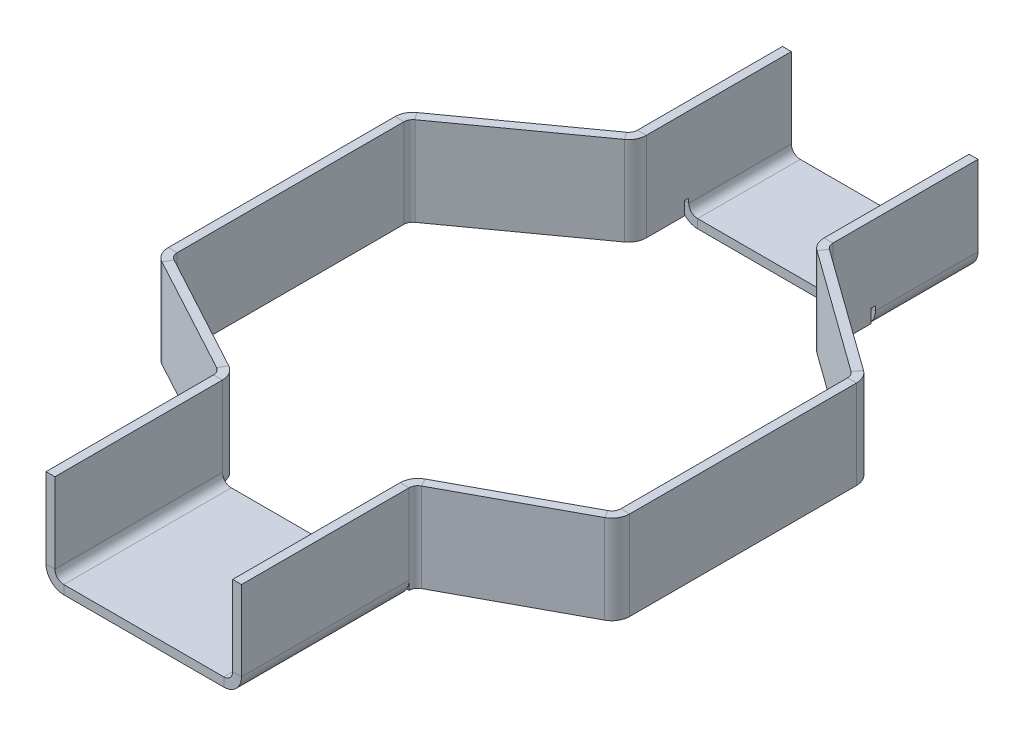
ISO-10303-21;
HEADER;
FILE_DESCRIPTION(('STEP AP214'),'2;1');
FILE_NAME('part.step','',(''),(''),'','','');
FILE_SCHEMA(('AUTOMOTIVE_DESIGN { 1 0 10303 214 1 1 1 1 }'));
ENDSEC;
DATA;
#1=APPLICATION_CONTEXT('core data for automotive mechanical design processes');
#2=APPLICATION_PROTOCOL_DEFINITION('international standard','automotive_design',2000,#1);
#3=PRODUCT_CONTEXT('',#1,'mechanical');
#4=PRODUCT('Part','Part','',(#3));
#5=PRODUCT_RELATED_PRODUCT_CATEGORY('part','',(#4));
#6=PRODUCT_DEFINITION_FORMATION('','',#4);
#7=PRODUCT_DEFINITION_CONTEXT('part definition',#1,'design');
#8=PRODUCT_DEFINITION('design','',#6,#7);
#9=PRODUCT_DEFINITION_SHAPE('','',#8);
#10=(LENGTH_UNIT() NAMED_UNIT(*) SI_UNIT(.MILLI.,.METRE.));
#11=(NAMED_UNIT(*) PLANE_ANGLE_UNIT() SI_UNIT($,.RADIAN.));
#12=(NAMED_UNIT(*) SI_UNIT($,.STERADIAN.) SOLID_ANGLE_UNIT());
#13=UNCERTAINTY_MEASURE_WITH_UNIT(LENGTH_MEASURE(1.E-05),#10,'distance_accuracy_value','');
#14=(GEOMETRIC_REPRESENTATION_CONTEXT(3) GLOBAL_UNCERTAINTY_ASSIGNED_CONTEXT((#13)) GLOBAL_UNIT_ASSIGNED_CONTEXT((#10,
#11,#12)) REPRESENTATION_CONTEXT('',''));
#15=CARTESIAN_POINT('',(0.,0.,0.));
#16=DIRECTION('',(0.,0.,1.));
#17=DIRECTION('',(1.,0.,0.));
#18=AXIS2_PLACEMENT_3D('',#15,#16,#17);
#19=CARTESIAN_POINT('',(-1.41569527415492,0.,-24.5931258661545));
#20=DIRECTION('',(0.,-1.,0.));
#21=DIRECTION('',(0.,0.,-1.));
#22=AXIS2_PLACEMENT_3D('',#19,#20,#21);
#23=PLANE('',#22);
#24=DIRECTION('',(0.,0.,-1.));
#25=VECTOR('',#24,1.);
#26=CARTESIAN_POINT('',(-1.,0.,-41.7305139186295));
#27=LINE('',#26,#25);
#28=CARTESIAN_POINT('',(-1.,0.,-29.6839401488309));
#29=VERTEX_POINT('',#28);
#30=CARTESIAN_POINT('',(-1.,0.,-25.404660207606));
#31=VERTEX_POINT('',#30);
#32=EDGE_CURVE('E1224',#29,#31,#27,.F.);
#33=ORIENTED_EDGE('',*,*,#32,.F.);
#34=DIRECTION('',(-1.,0.,0.));
#35=VECTOR('',#34,1.);
#36=CARTESIAN_POINT('',(0.,0.,-29.6839401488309));
#37=LINE('',#36,#35);
#38=CARTESIAN_POINT('',(0.,0.,-29.6839401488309));
#39=VERTEX_POINT('',#38);
#40=EDGE_CURVE('E1149',#39,#29,#37,.T.);
#41=ORIENTED_EDGE('',*,*,#40,.F.);
#42=DIRECTION('',(0.,0.,1.));
#43=VECTOR('',#42,1.);
#44=CARTESIAN_POINT('',(0.,0.,-41.7305139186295));
#45=LINE('',#44,#43);
#46=CARTESIAN_POINT('',(0.,0.,-25.404660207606));
#47=VERTEX_POINT('',#46);
#48=EDGE_CURVE('E1222',#39,#47,#45,.T.);
#49=ORIENTED_EDGE('',*,*,#48,.T.);
#50=DIRECTION('',(-1.,0.,0.));
#51=VECTOR('',#50,1.);
#52=CARTESIAN_POINT('',(0.,0.,-25.404660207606));
#53=LINE('',#52,#51);
#54=EDGE_CURVE('E1392',#47,#31,#53,.T.);
#55=ORIENTED_EDGE('',*,*,#54,.T.);
#56=EDGE_LOOP('',(#33,#41,#49,#55));
#57=FACE_BOUND('',#56,.T.);
#58=ADVANCED_FACE('F423',(#57),#23,.T.);
#59=CARTESIAN_POINT('',(0.,10.,-41.7305139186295));
#60=DIRECTION('',(1.,0.,0.));
#61=DIRECTION('',(0.,0.,-1.));
#62=AXIS2_PLACEMENT_3D('',#59,#60,#61);
#63=PLANE('',#62);
#64=DIRECTION('',(0.,1.,0.));
#65=VECTOR('',#64,1.);
#66=CARTESIAN_POINT('',(0.,0.999999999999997,-30.1839401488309));
#67=LINE('',#66,#65);
#68=CARTESIAN_POINT('',(0.,0.999999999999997,-30.1839401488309));
#69=VERTEX_POINT('',#68);
#70=CARTESIAN_POINT('',(0.,1.5,-30.1839401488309));
#71=VERTEX_POINT('',#70);
#72=EDGE_CURVE('E438',#69,#71,#67,.T.);
#73=ORIENTED_EDGE('',*,*,#72,.F.);
#74=DIRECTION('',(0.,0.,-1.));
#75=VECTOR('',#74,1.);
#76=CARTESIAN_POINT('',(0.,0.999999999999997,-41.7305139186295));
#77=LINE('',#76,#75);
#78=CARTESIAN_POINT('',(0.,0.999999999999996,-41.7305139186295));
#79=VERTEX_POINT('',#78);
#80=EDGE_CURVE('E1123',#79,#69,#77,.F.);
#81=ORIENTED_EDGE('',*,*,#80,.F.);
#82=DIRECTION('',(0.,-1.,0.));
#83=VECTOR('',#82,1.);
#84=CARTESIAN_POINT('',(0.,10.,-41.7305139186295));
#85=LINE('',#84,#83);
#86=CARTESIAN_POINT('',(0.,10.,-41.7305139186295));
#87=VERTEX_POINT('',#86);
#88=EDGE_CURVE('E1332',#87,#79,#85,.T.);
#89=ORIENTED_EDGE('',*,*,#88,.F.);
#90=DIRECTION('',(0.,0.,1.));
#91=VECTOR('',#90,1.);
#92=CARTESIAN_POINT('',(0.,10.,-41.7305139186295));
#93=LINE('',#92,#91);
#94=CARTESIAN_POINT('',(0.,10.,-25.404660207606));
#95=VERTEX_POINT('',#94);
#96=EDGE_CURVE('E1276',#87,#95,#93,.T.);
#97=ORIENTED_EDGE('',*,*,#96,.T.);
#98=DIRECTION('',(0.,-1.,0.));
#99=VECTOR('',#98,1.);
#100=CARTESIAN_POINT('',(0.,10.,-25.404660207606));
#101=LINE('',#100,#99);
#102=EDGE_CURVE('E1335',#95,#47,#101,.T.);
#103=ORIENTED_EDGE('',*,*,#102,.T.);
#104=ORIENTED_EDGE('',*,*,#48,.F.);
#105=DIRECTION('',(0.,-1.,0.));
#106=VECTOR('',#105,1.);
#107=CARTESIAN_POINT('',(0.,1.5,-29.6839401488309));
#108=LINE('',#107,#106);
#109=CARTESIAN_POINT('',(0.,1.5,-29.6839401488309));
#110=VERTEX_POINT('',#109);
#111=EDGE_CURVE('E1146',#110,#39,#108,.T.);
#112=ORIENTED_EDGE('',*,*,#111,.F.);
#113=DIRECTION('',(0.,0.,1.));
#114=VECTOR('',#113,1.);
#115=CARTESIAN_POINT('',(0.,1.5,-30.1839401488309));
#116=LINE('',#115,#114);
#117=EDGE_CURVE('E443',#71,#110,#116,.T.);
#118=ORIENTED_EDGE('',*,*,#117,.F.);
#119=EDGE_LOOP('',(#73,#81,#89,#97,#103,#104,#112,#118));
#120=FACE_BOUND('',#119,.T.);
#121=ADVANCED_FACE('F1514',(#120),#63,.T.);
#122=CARTESIAN_POINT('',(-1.,10.,-41.7305139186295));
#123=DIRECTION('',(0.,0.,-1.));
#124=DIRECTION('',(-1.,0.,0.));
#125=AXIS2_PLACEMENT_3D('',#122,#123,#124);
#126=PLANE('',#125);
#127=ORIENTED_EDGE('',*,*,#88,.T.);
#128=DIRECTION('',(-1.,0.,0.));
#129=VECTOR('',#128,1.);
#130=CARTESIAN_POINT('',(0.,0.999999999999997,-41.7305139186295));
#131=LINE('',#130,#129);
#132=CARTESIAN_POINT('',(-1.,0.999999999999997,-41.7305139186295));
#133=VERTEX_POINT('',#132);
#134=EDGE_CURVE('E1133',#79,#133,#131,.T.);
#135=ORIENTED_EDGE('',*,*,#134,.T.);
#136=DIRECTION('',(0.,-1.,0.));
#137=VECTOR('',#136,1.);
#138=CARTESIAN_POINT('',(-1.,10.,-41.7305139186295));
#139=LINE('',#138,#137);
#140=CARTESIAN_POINT('',(-1.,10.,-41.7305139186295));
#141=VERTEX_POINT('',#140);
#142=EDGE_CURVE('E1330',#141,#133,#139,.T.);
#143=ORIENTED_EDGE('',*,*,#142,.F.);
#144=DIRECTION('',(1.,0.,0.));
#145=VECTOR('',#144,1.);
#146=CARTESIAN_POINT('',(-1.,10.,-41.7305139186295));
#147=LINE('',#146,#145);
#148=EDGE_CURVE('E1279',#141,#87,#147,.T.);
#149=ORIENTED_EDGE('',*,*,#148,.T.);
#150=EDGE_LOOP('',(#127,#135,#143,#149));
#151=FACE_BOUND('',#150,.T.);
#152=ADVANCED_FACE('F1522',(#151),#126,.T.);
#153=CARTESIAN_POINT('',(-1.,10.,-41.7305139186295));
#154=DIRECTION('',(1.,0.,0.));
#155=DIRECTION('',(0.,0.,-1.));
#156=AXIS2_PLACEMENT_3D('',#153,#154,#155);
#157=PLANE('',#156);
#158=DIRECTION('',(0.,0.,-1.));
#159=VECTOR('',#158,1.);
#160=CARTESIAN_POINT('',(-1.,0.999999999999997,-41.7305139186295));
#161=LINE('',#160,#159);
#162=CARTESIAN_POINT('',(-1.,0.999999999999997,-30.1839401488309));
#163=VERTEX_POINT('',#162);
#164=EDGE_CURVE('E1128',#133,#163,#161,.F.);
#165=ORIENTED_EDGE('',*,*,#164,.T.);
#166=DIRECTION('',(0.,-1.,0.));
#167=VECTOR('',#166,1.);
#168=CARTESIAN_POINT('',(-1.,10.,-30.1839401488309));
#169=LINE('',#168,#167);
#170=CARTESIAN_POINT('',(-1.,1.5,-30.1839401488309));
#171=VERTEX_POINT('',#170);
#172=EDGE_CURVE('E11',#171,#163,#169,.T.);
#173=ORIENTED_EDGE('',*,*,#172,.F.);
#174=DIRECTION('',(0.,0.,-1.));
#175=VECTOR('',#174,1.);
#176=CARTESIAN_POINT('',(-1.,1.5,-41.7305139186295));
#177=LINE('',#176,#175);
#178=CARTESIAN_POINT('',(-1.,1.5,-29.6839401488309));
#179=VERTEX_POINT('',#178);
#180=EDGE_CURVE('E431',#179,#171,#177,.T.);
#181=ORIENTED_EDGE('',*,*,#180,.F.);
#182=DIRECTION('',(0.,1.,0.));
#183=VECTOR('',#182,1.);
#184=CARTESIAN_POINT('',(-1.,10.,-29.6839401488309));
#185=LINE('',#184,#183);
#186=EDGE_CURVE('E1399',#29,#179,#185,.T.);
#187=ORIENTED_EDGE('',*,*,#186,.F.);
#188=ORIENTED_EDGE('',*,*,#32,.T.);
#189=DIRECTION('',(0.,-1.,0.));
#190=VECTOR('',#189,1.);
#191=CARTESIAN_POINT('',(-1.,10.,-25.404660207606));
#192=LINE('',#191,#190);
#193=CARTESIAN_POINT('',(-1.,10.,-25.404660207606));
#194=VERTEX_POINT('',#193);
#195=EDGE_CURVE('E1327',#194,#31,#192,.T.);
#196=ORIENTED_EDGE('',*,*,#195,.F.);
#197=DIRECTION('',(0.,0.,-1.));
#198=VECTOR('',#197,1.);
#199=CARTESIAN_POINT('',(-1.,10.,-41.7305139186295));
#200=LINE('',#199,#198);
#201=EDGE_CURVE('E1282',#141,#194,#200,.F.);
#202=ORIENTED_EDGE('',*,*,#201,.F.);
#203=ORIENTED_EDGE('',*,*,#142,.T.);
#204=EDGE_LOOP('',(#165,#173,#181,#187,#188,#196,#202,#203));
#205=FACE_BOUND('',#204,.T.);
#206=ADVANCED_FACE('F1560',(#205),#157,.F.);
#207=CARTESIAN_POINT('',(0.,0.,22.2825861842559));
#208=DIRECTION('',(0.,0.,1.));
#209=DIRECTION('',(1.,0.,0.));
#210=AXIS2_PLACEMENT_3D('',#207,#208,#209);
#211=PLANE('',#210);
#212=DIRECTION('',(1.,0.,0.));
#213=VECTOR('',#212,1.);
#214=CARTESIAN_POINT('',(-1.,0.,22.2825861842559));
#215=LINE('',#214,#213);
#216=CARTESIAN_POINT('',(-1.,0.,22.2825861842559));
#217=VERTEX_POINT('',#216);
#218=CARTESIAN_POINT('',(-0.732050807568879,0.,22.2825861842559));
#219=VERTEX_POINT('',#218);
#220=EDGE_CURVE('E1365',#217,#219,#215,.T.);
#221=ORIENTED_EDGE('',*,*,#220,.T.);
#222=CARTESIAN_POINT('',(1.,0.999999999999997,22.2825861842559));
#223=DIRECTION('',(0.,0.,-1.));
#224=DIRECTION('',(-1.,0.,0.));
#225=AXIS2_PLACEMENT_3D('',#222,#223,#224);
#226=CIRCLE('',#225,2.);
#227=CARTESIAN_POINT('',(-1.,0.999999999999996,22.2825861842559));
#228=VERTEX_POINT('',#227);
#229=EDGE_CURVE('E1193',#219,#228,#226,.T.);
#230=ORIENTED_EDGE('',*,*,#229,.T.);
#231=DIRECTION('',(0.,-1.,0.));
#232=VECTOR('',#231,1.);
#233=CARTESIAN_POINT('',(-0.999999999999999,10.,22.2825861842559));
#234=LINE('',#233,#232);
#235=EDGE_CURVE('E1199',#228,#217,#234,.T.);
#236=ORIENTED_EDGE('',*,*,#235,.T.);
#237=EDGE_LOOP('',(#221,#230,#236));
#238=FACE_BOUND('',#237,.T.);
#239=ADVANCED_FACE('F1635',(#238),#211,.T.);
#240=CARTESIAN_POINT('',(-1.,10.,21.0896145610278));
#241=DIRECTION('',(1.,0.,0.));
#242=DIRECTION('',(0.,0.,-1.));
#243=AXIS2_PLACEMENT_3D('',#240,#241,#242);
#244=PLANE('',#243);
#245=DIRECTION('',(0.,0.,-1.));
#246=VECTOR('',#245,1.);
#247=CARTESIAN_POINT('',(-1.,0.999999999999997,22.2825861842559));
#248=LINE('',#247,#246);
#249=CARTESIAN_POINT('',(-1.,0.999999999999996,41.132226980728));
#250=VERTEX_POINT('',#249);
#251=EDGE_CURVE('E1185',#228,#250,#248,.F.);
#252=ORIENTED_EDGE('',*,*,#251,.T.);
#253=DIRECTION('',(0.,-1.,0.));
#254=VECTOR('',#253,1.);
#255=CARTESIAN_POINT('',(-1.,10.,41.132226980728));
#256=LINE('',#255,#254);
#257=CARTESIAN_POINT('',(-1.,10.,41.132226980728));
#258=VERTEX_POINT('',#257);
#259=EDGE_CURVE('E1361',#258,#250,#256,.T.);
#260=ORIENTED_EDGE('',*,*,#259,.F.);
#261=DIRECTION('',(0.,0.,-1.));
#262=VECTOR('',#261,1.);
#263=CARTESIAN_POINT('',(-1.,10.,21.0896145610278));
#264=LINE('',#263,#262);
#265=CARTESIAN_POINT('',(-1.,10.,22.2825861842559));
#266=VERTEX_POINT('',#265);
#267=EDGE_CURVE('E1247',#266,#258,#264,.F.);
#268=ORIENTED_EDGE('',*,*,#267,.F.);
#269=DIRECTION('',(0.,-1.,0.));
#270=VECTOR('',#269,1.);
#271=CARTESIAN_POINT('',(-1.,10.,22.2825861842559));
#272=LINE('',#271,#270);
#273=EDGE_CURVE('E1306',#266,#228,#272,.T.);
#274=ORIENTED_EDGE('',*,*,#273,.T.);
#275=EDGE_LOOP('',(#252,#260,#268,#274));
#276=FACE_BOUND('',#275,.T.);
#277=ADVANCED_FACE('F1638',(#276),#244,.F.);
#278=CARTESIAN_POINT('',(0.,10.,21.0896145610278));
#279=DIRECTION('',(1.,0.,0.));
#280=DIRECTION('',(0.,0.,-1.));
#281=AXIS2_PLACEMENT_3D('',#278,#279,#280);
#282=PLANE('',#281);
#283=DIRECTION('',(0.,-1.,0.));
#284=VECTOR('',#283,1.);
#285=CARTESIAN_POINT('',(0.,10.,41.132226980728));
#286=LINE('',#285,#284);
#287=CARTESIAN_POINT('',(0.,10.,41.132226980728));
#288=VERTEX_POINT('',#287);
#289=CARTESIAN_POINT('',(0.,0.999999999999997,41.132226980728));
#290=VERTEX_POINT('',#289);
#291=EDGE_CURVE('E1358',#288,#290,#286,.T.);
#292=ORIENTED_EDGE('',*,*,#291,.T.);
#293=DIRECTION('',(0.,0.,-1.));
#294=VECTOR('',#293,1.);
#295=CARTESIAN_POINT('',(0.,0.999999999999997,22.2825861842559));
#296=LINE('',#295,#294);
#297=CARTESIAN_POINT('',(0.,0.999999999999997,22.2825861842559));
#298=VERTEX_POINT('',#297);
#299=EDGE_CURVE('E1180',#298,#290,#296,.F.);
#300=ORIENTED_EDGE('',*,*,#299,.F.);
#301=DIRECTION('',(0.,-1.,0.));
#302=VECTOR('',#301,1.);
#303=CARTESIAN_POINT('',(0.,10.,22.2825861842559));
#304=LINE('',#303,#302);
#305=CARTESIAN_POINT('',(0.,10.,22.2825861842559));
#306=VERTEX_POINT('',#305);
#307=EDGE_CURVE('E1356',#306,#298,#304,.T.);
#308=ORIENTED_EDGE('',*,*,#307,.F.);
#309=DIRECTION('',(0.,0.,1.));
#310=VECTOR('',#309,1.);
#311=CARTESIAN_POINT('',(0.,10.,21.0896145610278));
#312=LINE('',#311,#310);
#313=EDGE_CURVE('E1252',#306,#288,#312,.T.);
#314=ORIENTED_EDGE('',*,*,#313,.T.);
#315=EDGE_LOOP('',(#292,#300,#308,#314));
#316=FACE_BOUND('',#315,.T.);
#317=ADVANCED_FACE('F1538',(#316),#282,.T.);
#318=CARTESIAN_POINT('',(-0.831390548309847,10.,-23.781591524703));
#319=DIRECTION('',(0.,1.,0.));
#320=DIRECTION('',(0.,0.,1.));
#321=AXIS2_PLACEMENT_3D('',#318,#319,#320);
#322=PLANE('',#321);
#323=DIRECTION('',(-0.584304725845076,0.,-0.811534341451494));
#324=VECTOR('',#323,1.);
#325=CARTESIAN_POINT('',(-0.831390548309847,10.,-23.781591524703));
#326=LINE('',#325,#324);
#327=CARTESIAN_POINT('',(-0.831390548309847,10.,-23.781591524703));
#328=VERTEX_POINT('',#327);
#329=CARTESIAN_POINT('',(-1.41569527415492,10.,-24.5931258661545));
#330=VERTEX_POINT('',#329);
#331=EDGE_CURVE('E1397',#328,#330,#326,.T.);
#332=ORIENTED_EDGE('',*,*,#331,.F.);
#333=CARTESIAN_POINT('',(-2.,10.,-25.404660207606));
#334=DIRECTION('',(0.,1.,0.));
#335=DIRECTION('',(0.,0.,1.));
#336=AXIS2_PLACEMENT_3D('',#333,#334,#335);
#337=CIRCLE('',#336,2.);
#338=EDGE_CURVE('E1273',#95,#328,#337,.F.);
#339=ORIENTED_EDGE('',*,*,#338,.F.);
#340=DIRECTION('',(1.,0.,0.));
#341=VECTOR('',#340,1.);
#342=CARTESIAN_POINT('',(-1.,10.,-25.404660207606));
#343=LINE('',#342,#341);
#344=EDGE_CURVE('E1395',#194,#95,#343,.T.);
#345=ORIENTED_EDGE('',*,*,#344,.F.);
#346=CARTESIAN_POINT('',(-2.,10.,-25.404660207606));
#347=DIRECTION('',(0.,1.,0.));
#348=DIRECTION('',(1.,0.,0.));
#349=AXIS2_PLACEMENT_3D('',#346,#347,#348);
#350=CIRCLE('',#349,1.);
#351=EDGE_CURVE('E1285',#194,#330,#350,.F.);
#352=ORIENTED_EDGE('',*,*,#351,.T.);
#353=EDGE_LOOP('',(#332,#339,#345,#352));
#354=FACE_BOUND('',#353,.T.);
#355=ADVANCED_FACE('F425',(#354),#322,.T.);
#356=CARTESIAN_POINT('',(-1.,10.,-25.404660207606));
#357=DIRECTION('',(0.,1.,0.));
#358=DIRECTION('',(0.,0.,1.));
#359=AXIS2_PLACEMENT_3D('',#356,#357,#358);
#360=PLANE('',#359);
#361=DIRECTION('',(-0.811534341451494,0.,0.584304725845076));
#362=VECTOR('',#361,1.);
#363=CARTESIAN_POINT('',(0.,10.,-24.3801927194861));
#364=LINE('',#363,#362);
#365=CARTESIAN_POINT('',(-14.5414781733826,10.,-13.9103284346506));
#366=VERTEX_POINT('',#365);
#367=EDGE_CURVE('E1270',#328,#366,#364,.T.);
#368=ORIENTED_EDGE('',*,*,#367,.F.);
#369=ORIENTED_EDGE('',*,*,#331,.T.);
#370=DIRECTION('',(-0.811534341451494,0.,0.584304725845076));
#371=VECTOR('',#370,1.);
#372=CARTESIAN_POINT('',(-0.584304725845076,10.,-25.1917270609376));
#373=LINE('',#372,#371);
#374=CARTESIAN_POINT('',(-15.1257828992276,10.,-14.7218627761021));
#375=VERTEX_POINT('',#374);
#376=EDGE_CURVE('E1288',#330,#375,#373,.T.);
#377=ORIENTED_EDGE('',*,*,#376,.T.);
#378=DIRECTION('',(0.584304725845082,0.,0.81153434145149));
#379=VECTOR('',#378,1.);
#380=CARTESIAN_POINT('',(-15.1257828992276,10.,-14.7218627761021));
#381=LINE('',#380,#379);
#382=EDGE_CURVE('E1386',#375,#366,#381,.T.);
#383=ORIENTED_EDGE('',*,*,#382,.T.);
#384=EDGE_LOOP('',(#368,#369,#377,#383));
#385=FACE_BOUND('',#384,.T.);
#386=ADVANCED_FACE('F1531',(#385),#360,.T.);
#387=CARTESIAN_POINT('',(0.,0.,-25.404660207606));
#388=DIRECTION('',(0.,-1.,0.));
#389=DIRECTION('',(0.,0.,-1.));
#390=AXIS2_PLACEMENT_3D('',#387,#388,#389);
#391=PLANE('',#390);
#392=ORIENTED_EDGE('',*,*,#54,.F.);
#393=CARTESIAN_POINT('',(-2.,0.,-25.404660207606));
#394=DIRECTION('',(0.,1.,0.));
#395=DIRECTION('',(0.,0.,1.));
#396=AXIS2_PLACEMENT_3D('',#393,#394,#395);
#397=CIRCLE('',#396,2.);
#398=CARTESIAN_POINT('',(-0.831390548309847,0.,-23.781591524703));
#399=VERTEX_POINT('',#398);
#400=EDGE_CURVE('E1219',#47,#399,#397,.F.);
#401=ORIENTED_EDGE('',*,*,#400,.T.);
#402=DIRECTION('',(0.584304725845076,0.,0.811534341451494));
#403=VECTOR('',#402,1.);
#404=CARTESIAN_POINT('',(-1.41569527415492,0.,-24.5931258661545));
#405=LINE('',#404,#403);
#406=CARTESIAN_POINT('',(-1.41569527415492,0.,-24.5931258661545));
#407=VERTEX_POINT('',#406);
#408=EDGE_CURVE('E1390',#407,#399,#405,.T.);
#409=ORIENTED_EDGE('',*,*,#408,.F.);
#410=CARTESIAN_POINT('',(-2.,0.,-25.404660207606));
#411=DIRECTION('',(0.,1.,0.));
#412=DIRECTION('',(1.,0.,0.));
#413=AXIS2_PLACEMENT_3D('',#410,#411,#412);
#414=CIRCLE('',#413,1.);
#415=EDGE_CURVE('E1226',#31,#407,#414,.F.);
#416=ORIENTED_EDGE('',*,*,#415,.F.);
#417=EDGE_LOOP('',(#392,#401,#409,#416));
#418=FACE_BOUND('',#417,.T.);
#419=ADVANCED_FACE('F1529',(#418),#391,.T.);
#420=CARTESIAN_POINT('',(-14.9571734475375,10.,-13.0987940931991));
#421=DIRECTION('',(0.,1.,0.));
#422=DIRECTION('',(0.,0.,1.));
#423=AXIS2_PLACEMENT_3D('',#420,#421,#422);
#424=PLANE('',#423);
#425=DIRECTION('',(-1.,0.,0.));
#426=VECTOR('',#425,1.);
#427=CARTESIAN_POINT('',(-14.9571734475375,10.,-13.0987940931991));
#428=LINE('',#427,#426);
#429=CARTESIAN_POINT('',(-14.9571734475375,10.,-13.0987940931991));
#430=VERTEX_POINT('',#429);
#431=CARTESIAN_POINT('',(-15.9571734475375,10.,-13.0987940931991));
#432=VERTEX_POINT('',#431);
#433=EDGE_CURVE('E1388',#430,#432,#428,.T.);
#434=ORIENTED_EDGE('',*,*,#433,.F.);
#435=CARTESIAN_POINT('',(-13.9571734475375,10.,-13.0987940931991));
#436=DIRECTION('',(0.,-1.,0.));
#437=DIRECTION('',(0.,0.,-1.));
#438=AXIS2_PLACEMENT_3D('',#435,#436,#437);
#439=CIRCLE('',#438,1.);
#440=EDGE_CURVE('E1267',#366,#430,#439,.F.);
#441=ORIENTED_EDGE('',*,*,#440,.F.);
#442=ORIENTED_EDGE('',*,*,#382,.F.);
#443=CARTESIAN_POINT('',(-13.9571734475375,10.,-13.0987940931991));
#444=DIRECTION('',(0.,1.,0.));
#445=DIRECTION('',(1.,0.,0.));
#446=AXIS2_PLACEMENT_3D('',#443,#444,#445);
#447=CIRCLE('',#446,2.);
#448=EDGE_CURVE('E1291',#375,#432,#447,.T.);
#449=ORIENTED_EDGE('',*,*,#448,.T.);
#450=EDGE_LOOP('',(#434,#441,#442,#449));
#451=FACE_BOUND('',#450,.T.);
#452=ADVANCED_FACE('F1527',(#451),#424,.T.);
#453=CARTESIAN_POINT('',(-15.1257828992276,10.,-14.7218627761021));
#454=DIRECTION('',(0.,1.,0.));
#455=DIRECTION('',(0.,0.,1.));
#456=AXIS2_PLACEMENT_3D('',#453,#454,#455);
#457=PLANE('',#456);
#458=DIRECTION('',(0.,0.,1.));
#459=VECTOR('',#458,1.);
#460=CARTESIAN_POINT('',(-14.9571734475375,10.,-13.6110278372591));
#461=LINE('',#460,#459);
#462=CARTESIAN_POINT('',(-14.9571734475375,10.,12.4162550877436));
#463=VERTEX_POINT('',#462);
#464=EDGE_CURVE('E1264',#430,#463,#461,.T.);
#465=ORIENTED_EDGE('',*,*,#464,.F.);
#466=ORIENTED_EDGE('',*,*,#433,.T.);
#467=DIRECTION('',(0.,0.,-1.));
#468=VECTOR('',#467,1.);
#469=CARTESIAN_POINT('',(-15.9571734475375,10.,-13.6110278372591));
#470=LINE('',#469,#468);
#471=CARTESIAN_POINT('',(-15.9571734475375,10.,12.4162550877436));
#472=VERTEX_POINT('',#471);
#473=EDGE_CURVE('E1294',#432,#472,#470,.F.);
#474=ORIENTED_EDGE('',*,*,#473,.T.);
#475=DIRECTION('',(1.,0.,0.));
#476=VECTOR('',#475,1.);
#477=CARTESIAN_POINT('',(-15.9571734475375,10.,12.4162550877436));
#478=LINE('',#477,#476);
#479=EDGE_CURVE('E1378',#472,#463,#478,.T.);
#480=ORIENTED_EDGE('',*,*,#479,.T.);
#481=EDGE_LOOP('',(#465,#466,#474,#480));
#482=FACE_BOUND('',#481,.T.);
#483=ADVANCED_FACE('F1737',(#482),#457,.T.);
#484=CARTESIAN_POINT('',(-14.5414781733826,0.,-13.9103284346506));
#485=DIRECTION('',(0.,-1.,0.));
#486=DIRECTION('',(0.,0.,-1.));
#487=AXIS2_PLACEMENT_3D('',#484,#485,#486);
#488=PLANE('',#487);
#489=DIRECTION('',(-0.584304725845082,0.,-0.81153434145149));
#490=VECTOR('',#489,1.);
#491=CARTESIAN_POINT('',(-14.5414781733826,0.,-13.9103284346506));
#492=LINE('',#491,#490);
#493=CARTESIAN_POINT('',(-14.5414781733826,0.,-13.9103284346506));
#494=VERTEX_POINT('',#493);
#495=CARTESIAN_POINT('',(-15.1257828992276,0.,-14.7218627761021));
#496=VERTEX_POINT('',#495);
#497=EDGE_CURVE('E1384',#494,#496,#492,.T.);
#498=ORIENTED_EDGE('',*,*,#497,.F.);
#499=CARTESIAN_POINT('',(-13.9571734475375,0.,-13.0987940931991));
#500=DIRECTION('',(0.,-1.,0.));
#501=DIRECTION('',(0.,0.,-1.));
#502=AXIS2_PLACEMENT_3D('',#499,#500,#501);
#503=CIRCLE('',#502,1.);
#504=CARTESIAN_POINT('',(-14.9571734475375,0.,-13.0987940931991));
#505=VERTEX_POINT('',#504);
#506=EDGE_CURVE('E1213',#494,#505,#503,.F.);
#507=ORIENTED_EDGE('',*,*,#506,.T.);
#508=DIRECTION('',(1.,0.,0.));
#509=VECTOR('',#508,1.);
#510=CARTESIAN_POINT('',(-15.9571734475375,0.,-13.0987940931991));
#511=LINE('',#510,#509);
#512=CARTESIAN_POINT('',(-15.9571734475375,0.,-13.0987940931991));
#513=VERTEX_POINT('',#512);
#514=EDGE_CURVE('E1382',#513,#505,#511,.T.);
#515=ORIENTED_EDGE('',*,*,#514,.F.);
#516=CARTESIAN_POINT('',(-13.9571734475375,0.,-13.0987940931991));
#517=DIRECTION('',(0.,1.,0.));
#518=DIRECTION('',(1.,0.,0.));
#519=AXIS2_PLACEMENT_3D('',#516,#517,#518);
#520=CIRCLE('',#519,2.);
#521=EDGE_CURVE('E1232',#496,#513,#520,.T.);
#522=ORIENTED_EDGE('',*,*,#521,.F.);
#523=EDGE_LOOP('',(#498,#507,#515,#522));
#524=FACE_BOUND('',#523,.T.);
#525=ADVANCED_FACE('F1735',(#524),#488,.T.);
#526=CARTESIAN_POINT('',(-15.9571734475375,0.,-13.0987940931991));
#527=DIRECTION('',(0.,-1.,0.));
#528=DIRECTION('',(0.,0.,-1.));
#529=AXIS2_PLACEMENT_3D('',#526,#527,#528);
#530=PLANE('',#529);
#531=DIRECTION('',(-0.811534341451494,0.,0.584304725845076));
#532=VECTOR('',#531,1.);
#533=CARTESIAN_POINT('',(0.,0.,-24.3801927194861));
#534=LINE('',#533,#532);
#535=EDGE_CURVE('E1216',#399,#494,#534,.T.);
#536=ORIENTED_EDGE('',*,*,#535,.T.);
#537=ORIENTED_EDGE('',*,*,#497,.T.);
#538=DIRECTION('',(-0.811534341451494,0.,0.584304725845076));
#539=VECTOR('',#538,1.);
#540=CARTESIAN_POINT('',(-0.584304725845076,0.,-25.1917270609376));
#541=LINE('',#540,#539);
#542=EDGE_CURVE('E1229',#407,#496,#541,.T.);
#543=ORIENTED_EDGE('',*,*,#542,.F.);
#544=ORIENTED_EDGE('',*,*,#408,.T.);
#545=EDGE_LOOP('',(#536,#537,#543,#544));
#546=FACE_BOUND('',#545,.T.);
#547=ADVANCED_FACE('F1731',(#546),#530,.T.);
#548=CARTESIAN_POINT('',(-14.4323223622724,10.,13.2961604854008));
#549=DIRECTION('',(0.,1.,0.));
#550=DIRECTION('',(0.,0.,1.));
#551=AXIS2_PLACEMENT_3D('',#548,#549,#550);
#552=PLANE('',#551);
#553=DIRECTION('',(-0.475148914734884,0.,0.879905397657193));
#554=VECTOR('',#553,1.);
#555=CARTESIAN_POINT('',(-14.4323223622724,10.,13.2961604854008));
#556=LINE('',#555,#554);
#557=CARTESIAN_POINT('',(-14.4323223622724,10.,13.2961604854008));
#558=VERTEX_POINT('',#557);
#559=CARTESIAN_POINT('',(-14.9074712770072,10.,14.176065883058));
#560=VERTEX_POINT('',#559);
#561=EDGE_CURVE('E1380',#558,#560,#556,.T.);
#562=ORIENTED_EDGE('',*,*,#561,.F.);
#563=CARTESIAN_POINT('',(-13.9571734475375,10.,12.4162550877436));
#564=DIRECTION('',(0.,-1.,0.));
#565=DIRECTION('',(0.,0.,-1.));
#566=AXIS2_PLACEMENT_3D('',#563,#564,#565);
#567=CIRCLE('',#566,1.);
#568=EDGE_CURVE('E1261',#463,#558,#567,.F.);
#569=ORIENTED_EDGE('',*,*,#568,.F.);
#570=ORIENTED_EDGE('',*,*,#479,.F.);
#571=CARTESIAN_POINT('',(-13.9571734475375,10.,12.4162550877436));
#572=DIRECTION('',(0.,1.,0.));
#573=DIRECTION('',(1.,0.,0.));
#574=AXIS2_PLACEMENT_3D('',#571,#572,#573);
#575=CIRCLE('',#574,2.);
#576=EDGE_CURVE('E1297',#472,#560,#575,.T.);
#577=ORIENTED_EDGE('',*,*,#576,.T.);
#578=EDGE_LOOP('',(#562,#569,#570,#577));
#579=FACE_BOUND('',#578,.T.);
#580=ADVANCED_FACE('F1727',(#579),#552,.T.);
#581=CARTESIAN_POINT('',(-15.9571734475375,10.,12.4162550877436));
#582=DIRECTION('',(0.,1.,0.));
#583=DIRECTION('',(0.,0.,1.));
#584=AXIS2_PLACEMENT_3D('',#581,#582,#583);
#585=PLANE('',#584);
#586=DIRECTION('',(0.879905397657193,0.,0.475148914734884));
#587=VECTOR('',#586,1.);
#588=CARTESIAN_POINT('',(-14.9571734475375,10.,13.0127408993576));
#589=LINE('',#588,#587);
#590=CARTESIAN_POINT('',(-1.04970217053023,10.,20.5227753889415));
#591=VERTEX_POINT('',#590);
#592=EDGE_CURVE('E1258',#558,#591,#589,.T.);
#593=ORIENTED_EDGE('',*,*,#592,.F.);
#594=ORIENTED_EDGE('',*,*,#561,.T.);
#595=DIRECTION('',(0.879905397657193,0.,0.475148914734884));
#596=VECTOR('',#595,1.);
#597=CARTESIAN_POINT('',(-15.4323223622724,10.,13.8926462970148));
#598=LINE('',#597,#596);
#599=CARTESIAN_POINT('',(-1.52485108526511,10.,21.4026807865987));
#600=VERTEX_POINT('',#599);
#601=EDGE_CURVE('E1300',#560,#600,#598,.T.);
#602=ORIENTED_EDGE('',*,*,#601,.T.);
#603=DIRECTION('',(0.475148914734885,0.,-0.879905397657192));
#604=VECTOR('',#603,1.);
#605=CARTESIAN_POINT('',(-1.52485108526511,10.,21.4026807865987));
#606=LINE('',#605,#604);
#607=EDGE_CURVE('E1370',#600,#591,#606,.T.);
#608=ORIENTED_EDGE('',*,*,#607,.T.);
#609=EDGE_LOOP('',(#593,#594,#602,#608));
#610=FACE_BOUND('',#609,.T.);
#611=ADVANCED_FACE('F1723',(#610),#585,.T.);
#612=CARTESIAN_POINT('',(-14.9571734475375,0.,12.4162550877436));
#613=DIRECTION('',(0.,-1.,0.));
#614=DIRECTION('',(0.,0.,-1.));
#615=AXIS2_PLACEMENT_3D('',#612,#613,#614);
#616=PLANE('',#615);
#617=DIRECTION('',(-1.,0.,0.));
#618=VECTOR('',#617,1.);
#619=CARTESIAN_POINT('',(-14.9571734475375,0.,12.4162550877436));
#620=LINE('',#619,#618);
#621=CARTESIAN_POINT('',(-14.9571734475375,0.,12.4162550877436));
#622=VERTEX_POINT('',#621);
#623=CARTESIAN_POINT('',(-15.9571734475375,0.,12.4162550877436));
#624=VERTEX_POINT('',#623);
#625=EDGE_CURVE('E1376',#622,#624,#620,.T.);
#626=ORIENTED_EDGE('',*,*,#625,.F.);
#627=CARTESIAN_POINT('',(-13.9571734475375,0.,12.4162550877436));
#628=DIRECTION('',(0.,-1.,0.));
#629=DIRECTION('',(0.,0.,-1.));
#630=AXIS2_PLACEMENT_3D('',#627,#628,#629);
#631=CIRCLE('',#630,1.);
#632=CARTESIAN_POINT('',(-14.4323223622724,0.,13.2961604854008));
#633=VERTEX_POINT('',#632);
#634=EDGE_CURVE('E1207',#622,#633,#631,.F.);
#635=ORIENTED_EDGE('',*,*,#634,.T.);
#636=DIRECTION('',(0.475148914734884,0.,-0.879905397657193));
#637=VECTOR('',#636,1.);
#638=CARTESIAN_POINT('',(-14.9074712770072,0.,14.176065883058));
#639=LINE('',#638,#637);
#640=CARTESIAN_POINT('',(-14.9074712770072,0.,14.176065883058));
#641=VERTEX_POINT('',#640);
#642=EDGE_CURVE('E1374',#641,#633,#639,.T.);
#643=ORIENTED_EDGE('',*,*,#642,.F.);
#644=CARTESIAN_POINT('',(-13.9571734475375,0.,12.4162550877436));
#645=DIRECTION('',(0.,1.,0.));
#646=DIRECTION('',(1.,0.,0.));
#647=AXIS2_PLACEMENT_3D('',#644,#645,#646);
#648=CIRCLE('',#647,2.);
#649=EDGE_CURVE('E1238',#624,#641,#648,.T.);
#650=ORIENTED_EDGE('',*,*,#649,.F.);
#651=EDGE_LOOP('',(#626,#635,#643,#650));
#652=FACE_BOUND('',#651,.T.);
#653=ADVANCED_FACE('F1719',(#652),#616,.T.);
#654=CARTESIAN_POINT('',(-14.9074712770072,0.,14.176065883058));
#655=DIRECTION('',(0.,-1.,0.));
#656=DIRECTION('',(0.,0.,-1.));
#657=AXIS2_PLACEMENT_3D('',#654,#655,#656);
#658=PLANE('',#657);
#659=DIRECTION('',(0.,0.,1.));
#660=VECTOR('',#659,1.);
#661=CARTESIAN_POINT('',(-14.9571734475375,0.,-13.6110278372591));
#662=LINE('',#661,#660);
#663=EDGE_CURVE('E1210',#505,#622,#662,.T.);
#664=ORIENTED_EDGE('',*,*,#663,.T.);
#665=ORIENTED_EDGE('',*,*,#625,.T.);
#666=DIRECTION('',(0.,0.,-1.));
#667=VECTOR('',#666,1.);
#668=CARTESIAN_POINT('',(-15.9571734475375,0.,-13.6110278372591));
#669=LINE('',#668,#667);
#670=EDGE_CURVE('E1235',#513,#624,#669,.F.);
#671=ORIENTED_EDGE('',*,*,#670,.F.);
#672=ORIENTED_EDGE('',*,*,#514,.T.);
#673=EDGE_LOOP('',(#664,#665,#671,#672));
#674=FACE_BOUND('',#673,.T.);
#675=ADVANCED_FACE('F1715',(#674),#658,.T.);
#676=CARTESIAN_POINT('',(0.,10.,22.2825861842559));
#677=DIRECTION('',(0.,1.,0.));
#678=DIRECTION('',(0.,0.,1.));
#679=AXIS2_PLACEMENT_3D('',#676,#677,#678);
#680=PLANE('',#679);
#681=DIRECTION('',(-1.,0.,0.));
#682=VECTOR('',#681,1.);
#683=CARTESIAN_POINT('',(0.,10.,22.2825861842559));
#684=LINE('',#683,#682);
#685=EDGE_CURVE('E1372',#306,#266,#684,.T.);
#686=ORIENTED_EDGE('',*,*,#685,.F.);
#687=CARTESIAN_POINT('',(-2.,10.,22.2825861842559));
#688=DIRECTION('',(0.,1.,0.));
#689=DIRECTION('',(0.,0.,1.));
#690=AXIS2_PLACEMENT_3D('',#687,#688,#689);
#691=CIRCLE('',#690,2.);
#692=EDGE_CURVE('E1255',#591,#306,#691,.F.);
#693=ORIENTED_EDGE('',*,*,#692,.F.);
#694=ORIENTED_EDGE('',*,*,#607,.F.);
#695=CARTESIAN_POINT('',(-2.,10.,22.2825861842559));
#696=DIRECTION('',(0.,1.,0.));
#697=DIRECTION('',(1.,0.,0.));
#698=AXIS2_PLACEMENT_3D('',#695,#696,#697);
#699=CIRCLE('',#698,1.);
#700=EDGE_CURVE('E1303',#600,#266,#699,.F.);
#701=ORIENTED_EDGE('',*,*,#700,.T.);
#702=EDGE_LOOP('',(#686,#693,#694,#701));
#703=FACE_BOUND('',#702,.T.);
#704=ADVANCED_FACE('F1711',(#703),#680,.T.);
#705=CARTESIAN_POINT('',(-1.52485108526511,10.,21.4026807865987));
#706=DIRECTION('',(0.,1.,0.));
#707=DIRECTION('',(0.,0.,1.));
#708=AXIS2_PLACEMENT_3D('',#705,#706,#707);
#709=PLANE('',#708);
#710=ORIENTED_EDGE('',*,*,#313,.F.);
#711=ORIENTED_EDGE('',*,*,#685,.T.);
#712=ORIENTED_EDGE('',*,*,#267,.T.);
#713=DIRECTION('',(-1.,0.,0.));
#714=VECTOR('',#713,1.);
#715=CARTESIAN_POINT('',(0.,10.,41.132226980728));
#716=LINE('',#715,#714);
#717=EDGE_CURVE('E1249',#288,#258,#716,.T.);
#718=ORIENTED_EDGE('',*,*,#717,.F.);
#719=EDGE_LOOP('',(#710,#711,#712,#718));
#720=FACE_BOUND('',#719,.T.);
#721=ADVANCED_FACE('F1707',(#720),#709,.T.);
#722=CARTESIAN_POINT('',(-1.04970217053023,0.,20.5227753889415));
#723=DIRECTION('',(0.,-1.,0.));
#724=DIRECTION('',(0.,0.,-1.));
#725=AXIS2_PLACEMENT_3D('',#722,#723,#724);
#726=PLANE('',#725);
#727=DIRECTION('',(-0.475148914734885,0.,0.879905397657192));
#728=VECTOR('',#727,1.);
#729=CARTESIAN_POINT('',(-1.04970217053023,0.,20.5227753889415));
#730=LINE('',#729,#728);
#731=CARTESIAN_POINT('',(-1.04970217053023,0.,20.5227753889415));
#732=VERTEX_POINT('',#731);
#733=CARTESIAN_POINT('',(-1.52485108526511,0.,21.4026807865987));
#734=VERTEX_POINT('',#733);
#735=EDGE_CURVE('E1368',#732,#734,#730,.T.);
#736=ORIENTED_EDGE('',*,*,#735,.F.);
#737=CARTESIAN_POINT('',(-2.,0.,22.2825861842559));
#738=DIRECTION('',(0.,1.,0.));
#739=DIRECTION('',(0.,0.,1.));
#740=AXIS2_PLACEMENT_3D('',#737,#738,#739);
#741=CIRCLE('',#740,2.);
#742=CARTESIAN_POINT('',(0.,0.,22.2825861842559));
#743=VERTEX_POINT('',#742);
#744=EDGE_CURVE('E1202',#732,#743,#741,.F.);
#745=ORIENTED_EDGE('',*,*,#744,.T.);
#746=EDGE_CURVE('E1364',#219,#743,#215,.T.);
#747=ORIENTED_EDGE('',*,*,#746,.F.);
#748=ORIENTED_EDGE('',*,*,#220,.F.);
#749=CARTESIAN_POINT('',(-2.,0.,22.2825861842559));
#750=DIRECTION('',(0.,1.,0.));
#751=DIRECTION('',(1.,0.,0.));
#752=AXIS2_PLACEMENT_3D('',#749,#750,#751);
#753=CIRCLE('',#752,1.);
#754=EDGE_CURVE('E1244',#734,#217,#753,.F.);
#755=ORIENTED_EDGE('',*,*,#754,.F.);
#756=EDGE_LOOP('',(#736,#745,#747,#748,#755));
#757=FACE_BOUND('',#756,.T.);
#758=ADVANCED_FACE('F1703',(#757),#726,.T.);
#759=CARTESIAN_POINT('',(-1.,0.,22.2825861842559));
#760=DIRECTION('',(0.,-1.,0.));
#761=DIRECTION('',(0.,0.,-1.));
#762=AXIS2_PLACEMENT_3D('',#759,#760,#761);
#763=PLANE('',#762);
#764=DIRECTION('',(0.879905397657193,0.,0.475148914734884));
#765=VECTOR('',#764,1.);
#766=CARTESIAN_POINT('',(-14.9571734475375,0.,13.0127408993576));
#767=LINE('',#766,#765);
#768=EDGE_CURVE('E1204',#633,#732,#767,.T.);
#769=ORIENTED_EDGE('',*,*,#768,.T.);
#770=ORIENTED_EDGE('',*,*,#735,.T.);
#771=DIRECTION('',(0.879905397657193,0.,0.475148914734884));
#772=VECTOR('',#771,1.);
#773=CARTESIAN_POINT('',(-15.4323223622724,0.,13.8926462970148));
#774=LINE('',#773,#772);
#775=EDGE_CURVE('E1241',#641,#734,#774,.T.);
#776=ORIENTED_EDGE('',*,*,#775,.F.);
#777=ORIENTED_EDGE('',*,*,#642,.T.);
#778=EDGE_LOOP('',(#769,#770,#776,#777));
#779=FACE_BOUND('',#778,.T.);
#780=ADVANCED_FACE('F1696',(#779),#763,.T.);
#781=CARTESIAN_POINT('',(0.,10.,41.132226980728));
#782=DIRECTION('',(0.,0.,1.));
#783=DIRECTION('',(1.,0.,0.));
#784=AXIS2_PLACEMENT_3D('',#781,#782,#783);
#785=PLANE('',#784);
#786=DIRECTION('',(-1.,0.,0.));
#787=VECTOR('',#786,1.);
#788=CARTESIAN_POINT('',(0.,0.999999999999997,41.132226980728));
#789=LINE('',#788,#787);
#790=EDGE_CURVE('E1190',#290,#250,#789,.T.);
#791=ORIENTED_EDGE('',*,*,#790,.F.);
#792=ORIENTED_EDGE('',*,*,#291,.F.);
#793=ORIENTED_EDGE('',*,*,#717,.T.);
#794=ORIENTED_EDGE('',*,*,#259,.T.);
#795=EDGE_LOOP('',(#791,#792,#793,#794));
#796=FACE_BOUND('',#795,.T.);
#797=ADVANCED_FACE('F1689',(#796),#785,.T.);
#798=CARTESIAN_POINT('',(-2.,10.,22.2825861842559));
#799=DIRECTION('',(0.,-1.,0.));
#800=DIRECTION('',(0.,0.,-1.));
#801=AXIS2_PLACEMENT_3D('',#798,#799,#800);
#802=CYLINDRICAL_SURFACE('',#801,2.);
#803=ORIENTED_EDGE('',*,*,#744,.F.);
#804=DIRECTION('',(0.,-1.,0.));
#805=VECTOR('',#804,1.);
#806=CARTESIAN_POINT('',(-1.04970217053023,10.,20.5227753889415));
#807=LINE('',#806,#805);
#808=EDGE_CURVE('E1353',#591,#732,#807,.T.);
#809=ORIENTED_EDGE('',*,*,#808,.F.);
#810=ORIENTED_EDGE('',*,*,#692,.T.);
#811=ORIENTED_EDGE('',*,*,#307,.T.);
#812=DIRECTION('',(0.,1.,0.));
#813=VECTOR('',#812,1.);
#814=CARTESIAN_POINT('',(0.,0.,22.2825861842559));
#815=LINE('',#814,#813);
#816=EDGE_CURVE('E1196',#743,#298,#815,.T.);
#817=ORIENTED_EDGE('',*,*,#816,.F.);
#818=EDGE_LOOP('',(#803,#809,#810,#811,#817));
#819=FACE_BOUND('',#818,.T.);
#820=ADVANCED_FACE('F1685',(#819),#802,.T.);
#821=CARTESIAN_POINT('',(-14.9571734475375,10.,13.0127408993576));
#822=DIRECTION('',(0.475148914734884,0.,-0.879905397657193));
#823=DIRECTION('',(-0.879905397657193,0.,-0.475148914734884));
#824=AXIS2_PLACEMENT_3D('',#821,#822,#823);
#825=PLANE('',#824);
#826=ORIENTED_EDGE('',*,*,#768,.F.);
#827=DIRECTION('',(0.,-1.,0.));
#828=VECTOR('',#827,1.);
#829=CARTESIAN_POINT('',(-14.4323223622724,10.,13.2961604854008));
#830=LINE('',#829,#828);
#831=EDGE_CURVE('E1350',#558,#633,#830,.T.);
#832=ORIENTED_EDGE('',*,*,#831,.F.);
#833=ORIENTED_EDGE('',*,*,#592,.T.);
#834=ORIENTED_EDGE('',*,*,#808,.T.);
#835=EDGE_LOOP('',(#826,#832,#833,#834));
#836=FACE_BOUND('',#835,.T.);
#837=ADVANCED_FACE('F1681',(#836),#825,.T.);
#838=CARTESIAN_POINT('',(-13.9571734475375,10.,12.4162550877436));
#839=DIRECTION('',(0.,-1.,0.));
#840=DIRECTION('',(0.,0.,-1.));
#841=AXIS2_PLACEMENT_3D('',#838,#839,#840);
#842=CYLINDRICAL_SURFACE('',#841,1.);
#843=ORIENTED_EDGE('',*,*,#634,.F.);
#844=DIRECTION('',(0.,-1.,0.));
#845=VECTOR('',#844,1.);
#846=CARTESIAN_POINT('',(-14.9571734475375,10.,12.4162550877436));
#847=LINE('',#846,#845);
#848=EDGE_CURVE('E1347',#463,#622,#847,.T.);
#849=ORIENTED_EDGE('',*,*,#848,.F.);
#850=ORIENTED_EDGE('',*,*,#568,.T.);
#851=ORIENTED_EDGE('',*,*,#831,.T.);
#852=EDGE_LOOP('',(#843,#849,#850,#851));
#853=FACE_BOUND('',#852,.T.);
#854=ADVANCED_FACE('F1677',(#853),#842,.F.);
#855=CARTESIAN_POINT('',(-14.9571734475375,10.,-13.6110278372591));
#856=DIRECTION('',(1.,0.,0.));
#857=DIRECTION('',(0.,0.,-1.));
#858=AXIS2_PLACEMENT_3D('',#855,#856,#857);
#859=PLANE('',#858);
#860=ORIENTED_EDGE('',*,*,#663,.F.);
#861=DIRECTION('',(0.,-1.,0.));
#862=VECTOR('',#861,1.);
#863=CARTESIAN_POINT('',(-14.9571734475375,10.,-13.0987940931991));
#864=LINE('',#863,#862);
#865=EDGE_CURVE('E1344',#430,#505,#864,.T.);
#866=ORIENTED_EDGE('',*,*,#865,.F.);
#867=ORIENTED_EDGE('',*,*,#464,.T.);
#868=ORIENTED_EDGE('',*,*,#848,.T.);
#869=EDGE_LOOP('',(#860,#866,#867,#868));
#870=FACE_BOUND('',#869,.T.);
#871=ADVANCED_FACE('F1674',(#870),#859,.T.);
#872=CARTESIAN_POINT('',(-13.9571734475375,10.,-13.0987940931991));
#873=DIRECTION('',(0.,-1.,0.));
#874=DIRECTION('',(0.,0.,-1.));
#875=AXIS2_PLACEMENT_3D('',#872,#873,#874);
#876=CYLINDRICAL_SURFACE('',#875,1.);
#877=ORIENTED_EDGE('',*,*,#506,.F.);
#878=DIRECTION('',(0.,-1.,0.));
#879=VECTOR('',#878,1.);
#880=CARTESIAN_POINT('',(-14.5414781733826,10.,-13.9103284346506));
#881=LINE('',#880,#879);
#882=EDGE_CURVE('E1341',#366,#494,#881,.T.);
#883=ORIENTED_EDGE('',*,*,#882,.F.);
#884=ORIENTED_EDGE('',*,*,#440,.T.);
#885=ORIENTED_EDGE('',*,*,#865,.T.);
#886=EDGE_LOOP('',(#877,#883,#884,#885));
#887=FACE_BOUND('',#886,.T.);
#888=ADVANCED_FACE('F1582',(#887),#876,.F.);
#889=CARTESIAN_POINT('',(0.,10.,-24.3801927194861));
#890=DIRECTION('',(0.584304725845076,0.,0.811534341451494));
#891=DIRECTION('',(0.811534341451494,0.,-0.584304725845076));
#892=AXIS2_PLACEMENT_3D('',#889,#890,#891);
#893=PLANE('',#892);
#894=ORIENTED_EDGE('',*,*,#535,.F.);
#895=DIRECTION('',(0.,-1.,0.));
#896=VECTOR('',#895,1.);
#897=CARTESIAN_POINT('',(-0.831390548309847,10.,-23.781591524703));
#898=LINE('',#897,#896);
#899=EDGE_CURVE('E1338',#328,#399,#898,.T.);
#900=ORIENTED_EDGE('',*,*,#899,.F.);
#901=ORIENTED_EDGE('',*,*,#367,.T.);
#902=ORIENTED_EDGE('',*,*,#882,.T.);
#903=EDGE_LOOP('',(#894,#900,#901,#902));
#904=FACE_BOUND('',#903,.T.);
#905=ADVANCED_FACE('F1584',(#904),#893,.T.);
#906=CARTESIAN_POINT('',(-2.,10.,-25.404660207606));
#907=DIRECTION('',(0.,-1.,0.));
#908=DIRECTION('',(0.,0.,-1.));
#909=AXIS2_PLACEMENT_3D('',#906,#907,#908);
#910=CYLINDRICAL_SURFACE('',#909,2.);
#911=ORIENTED_EDGE('',*,*,#400,.F.);
#912=ORIENTED_EDGE('',*,*,#102,.F.);
#913=ORIENTED_EDGE('',*,*,#338,.T.);
#914=ORIENTED_EDGE('',*,*,#899,.T.);
#915=EDGE_LOOP('',(#911,#912,#913,#914));
#916=FACE_BOUND('',#915,.T.);
#917=ADVANCED_FACE('F1548',(#916),#910,.T.);
#918=CARTESIAN_POINT('',(-2.,10.,-25.404660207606));
#919=DIRECTION('',(0.,-1.,0.));
#920=DIRECTION('',(0.,0.,-1.));
#921=AXIS2_PLACEMENT_3D('',#918,#919,#920);
#922=CYLINDRICAL_SURFACE('',#921,1.);
#923=ORIENTED_EDGE('',*,*,#415,.T.);
#924=DIRECTION('',(0.,-1.,0.));
#925=VECTOR('',#924,1.);
#926=CARTESIAN_POINT('',(-1.41569527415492,10.,-24.5931258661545));
#927=LINE('',#926,#925);
#928=EDGE_CURVE('E1324',#330,#407,#927,.T.);
#929=ORIENTED_EDGE('',*,*,#928,.F.);
#930=ORIENTED_EDGE('',*,*,#351,.F.);
#931=ORIENTED_EDGE('',*,*,#195,.T.);
#932=EDGE_LOOP('',(#923,#929,#930,#931));
#933=FACE_BOUND('',#932,.T.);
#934=ADVANCED_FACE('F1565',(#933),#922,.F.);
#935=CARTESIAN_POINT('',(-0.584304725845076,10.,-25.1917270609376));
#936=DIRECTION('',(0.584304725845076,0.,0.811534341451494));
#937=DIRECTION('',(0.811534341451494,0.,-0.584304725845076));
#938=AXIS2_PLACEMENT_3D('',#935,#936,#937);
#939=PLANE('',#938);
#940=ORIENTED_EDGE('',*,*,#542,.T.);
#941=DIRECTION('',(0.,-1.,0.));
#942=VECTOR('',#941,1.);
#943=CARTESIAN_POINT('',(-15.1257828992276,10.,-14.7218627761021));
#944=LINE('',#943,#942);
#945=EDGE_CURVE('E1321',#375,#496,#944,.T.);
#946=ORIENTED_EDGE('',*,*,#945,.F.);
#947=ORIENTED_EDGE('',*,*,#376,.F.);
#948=ORIENTED_EDGE('',*,*,#928,.T.);
#949=EDGE_LOOP('',(#940,#946,#947,#948));
#950=FACE_BOUND('',#949,.T.);
#951=ADVANCED_FACE('F1570',(#950),#939,.F.);
#952=CARTESIAN_POINT('',(-13.9571734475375,10.,-13.0987940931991));
#953=DIRECTION('',(0.,-1.,0.));
#954=DIRECTION('',(0.,0.,-1.));
#955=AXIS2_PLACEMENT_3D('',#952,#953,#954);
#956=CYLINDRICAL_SURFACE('',#955,2.);
#957=ORIENTED_EDGE('',*,*,#521,.T.);
#958=DIRECTION('',(0.,-1.,0.));
#959=VECTOR('',#958,1.);
#960=CARTESIAN_POINT('',(-15.9571734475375,10.,-13.0987940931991));
#961=LINE('',#960,#959);
#962=EDGE_CURVE('E1318',#432,#513,#961,.T.);
#963=ORIENTED_EDGE('',*,*,#962,.F.);
#964=ORIENTED_EDGE('',*,*,#448,.F.);
#965=ORIENTED_EDGE('',*,*,#945,.T.);
#966=EDGE_LOOP('',(#957,#963,#964,#965));
#967=FACE_BOUND('',#966,.T.);
#968=ADVANCED_FACE('F1575',(#967),#956,.T.);
#969=CARTESIAN_POINT('',(-15.9571734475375,10.,-13.6110278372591));
#970=DIRECTION('',(1.,0.,0.));
#971=DIRECTION('',(0.,0.,-1.));
#972=AXIS2_PLACEMENT_3D('',#969,#970,#971);
#973=PLANE('',#972);
#974=ORIENTED_EDGE('',*,*,#670,.T.);
#975=DIRECTION('',(0.,-1.,0.));
#976=VECTOR('',#975,1.);
#977=CARTESIAN_POINT('',(-15.9571734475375,10.,12.4162550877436));
#978=LINE('',#977,#976);
#979=EDGE_CURVE('E1315',#472,#624,#978,.T.);
#980=ORIENTED_EDGE('',*,*,#979,.F.);
#981=ORIENTED_EDGE('',*,*,#473,.F.);
#982=ORIENTED_EDGE('',*,*,#962,.T.);
#983=EDGE_LOOP('',(#974,#980,#981,#982));
#984=FACE_BOUND('',#983,.T.);
#985=ADVANCED_FACE('F1653',(#984),#973,.F.);
#986=CARTESIAN_POINT('',(-13.9571734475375,10.,12.4162550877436));
#987=DIRECTION('',(0.,-1.,0.));
#988=DIRECTION('',(0.,0.,-1.));
#989=AXIS2_PLACEMENT_3D('',#986,#987,#988);
#990=CYLINDRICAL_SURFACE('',#989,2.);
#991=ORIENTED_EDGE('',*,*,#649,.T.);
#992=DIRECTION('',(0.,-1.,0.));
#993=VECTOR('',#992,1.);
#994=CARTESIAN_POINT('',(-14.9074712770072,10.,14.176065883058));
#995=LINE('',#994,#993);
#996=EDGE_CURVE('E1312',#560,#641,#995,.T.);
#997=ORIENTED_EDGE('',*,*,#996,.F.);
#998=ORIENTED_EDGE('',*,*,#576,.F.);
#999=ORIENTED_EDGE('',*,*,#979,.T.);
#1000=EDGE_LOOP('',(#991,#997,#998,#999));
#1001=FACE_BOUND('',#1000,.T.);
#1002=ADVANCED_FACE('F1649',(#1001),#990,.T.);
#1003=CARTESIAN_POINT('',(-15.4323223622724,10.,13.8926462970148));
#1004=DIRECTION('',(0.475148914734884,0.,-0.879905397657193));
#1005=DIRECTION('',(-0.879905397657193,0.,-0.475148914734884));
#1006=AXIS2_PLACEMENT_3D('',#1003,#1004,#1005);
#1007=PLANE('',#1006);
#1008=ORIENTED_EDGE('',*,*,#775,.T.);
#1009=DIRECTION('',(0.,-1.,0.));
#1010=VECTOR('',#1009,1.);
#1011=CARTESIAN_POINT('',(-1.52485108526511,10.,21.4026807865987));
#1012=LINE('',#1011,#1010);
#1013=EDGE_CURVE('E1309',#600,#734,#1012,.T.);
#1014=ORIENTED_EDGE('',*,*,#1013,.F.);
#1015=ORIENTED_EDGE('',*,*,#601,.F.);
#1016=ORIENTED_EDGE('',*,*,#996,.T.);
#1017=EDGE_LOOP('',(#1008,#1014,#1015,#1016));
#1018=FACE_BOUND('',#1017,.T.);
#1019=ADVANCED_FACE('F1645',(#1018),#1007,.F.);
#1020=CARTESIAN_POINT('',(-2.,10.,22.2825861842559));
#1021=DIRECTION('',(0.,-1.,0.));
#1022=DIRECTION('',(0.,0.,-1.));
#1023=AXIS2_PLACEMENT_3D('',#1020,#1021,#1022);
#1024=CYLINDRICAL_SURFACE('',#1023,1.);
#1025=ORIENTED_EDGE('',*,*,#754,.T.);
#1026=ORIENTED_EDGE('',*,*,#235,.F.);
#1027=ORIENTED_EDGE('',*,*,#273,.F.);
#1028=ORIENTED_EDGE('',*,*,#700,.F.);
#1029=ORIENTED_EDGE('',*,*,#1013,.T.);
#1030=EDGE_LOOP('',(#1025,#1026,#1027,#1028,#1029));
#1031=FACE_BOUND('',#1030,.T.);
#1032=ADVANCED_FACE('F1642',(#1031),#1024,.F.);
#1033=CARTESIAN_POINT('',(-2.,10.,22.2825861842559));
#1034=DIRECTION('',(0.,1.,0.));
#1035=DIRECTION('',(0.,0.,1.));
#1036=AXIS2_PLACEMENT_3D('',#1033,#1034,#1035);
#1037=PLANE('',#1036);
#1038=ORIENTED_EDGE('',*,*,#201,.T.);
#1039=ORIENTED_EDGE('',*,*,#344,.T.);
#1040=ORIENTED_EDGE('',*,*,#96,.F.);
#1041=ORIENTED_EDGE('',*,*,#148,.F.);
#1042=EDGE_LOOP('',(#1038,#1039,#1040,#1041));
#1043=FACE_BOUND('',#1042,.T.);
#1044=ADVANCED_FACE('F1554',(#1043),#1037,.T.);
#1045=CARTESIAN_POINT('',(1.,0.999999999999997,41.132226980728));
#1046=DIRECTION('',(0.,0.,1.));
#1047=DIRECTION('',(1.,0.,0.));
#1048=AXIS2_PLACEMENT_3D('',#1045,#1046,#1047);
#1049=PLANE('',#1048);
#1050=DIRECTION('',(0.,-1.,0.));
#1051=VECTOR('',#1050,1.);
#1052=CARTESIAN_POINT('',(0.999999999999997,0.,41.132226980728));
#1053=LINE('',#1052,#1051);
#1054=CARTESIAN_POINT('',(0.999999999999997,0.,41.132226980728));
#1055=VERTEX_POINT('',#1054);
#1056=CARTESIAN_POINT('',(0.999999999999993,-1.,41.132226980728));
#1057=VERTEX_POINT('',#1056);
#1058=EDGE_CURVE('E1143',#1055,#1057,#1053,.T.);
#1059=ORIENTED_EDGE('',*,*,#1058,.F.);
#1060=CARTESIAN_POINT('',(1.,0.999999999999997,41.132226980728));
#1061=DIRECTION('',(0.,0.,-1.));
#1062=DIRECTION('',(-1.,0.,0.));
#1063=AXIS2_PLACEMENT_3D('',#1060,#1061,#1062);
#1064=CIRCLE('',#1063,1.);
#1065=EDGE_CURVE('E1176',#290,#1055,#1064,.F.);
#1066=ORIENTED_EDGE('',*,*,#1065,.F.);
#1067=ORIENTED_EDGE('',*,*,#790,.T.);
#1068=CARTESIAN_POINT('',(1.,0.999999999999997,41.132226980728));
#1069=DIRECTION('',(0.,0.,-1.));
#1070=DIRECTION('',(-1.,0.,0.));
#1071=AXIS2_PLACEMENT_3D('',#1068,#1069,#1070);
#1072=CIRCLE('',#1071,2.);
#1073=EDGE_CURVE('E1187',#250,#1057,#1072,.F.);
#1074=ORIENTED_EDGE('',*,*,#1073,.T.);
#1075=EDGE_LOOP('',(#1059,#1066,#1067,#1074));
#1076=FACE_BOUND('',#1075,.T.);
#1077=ADVANCED_FACE('F1628',(#1076),#1049,.T.);
#1078=CARTESIAN_POINT('',(1.,0.999999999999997,22.2825861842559));
#1079=DIRECTION('',(0.,0.,1.));
#1080=DIRECTION('',(1.,0.,0.));
#1081=AXIS2_PLACEMENT_3D('',#1078,#1079,#1080);
#1082=PLANE('',#1081);
#1083=CARTESIAN_POINT('',(0.999999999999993,-1.,22.2825861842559));
#1084=VERTEX_POINT('',#1083);
#1085=EDGE_CURVE('E1179',#1084,#219,#226,.T.);
#1086=ORIENTED_EDGE('',*,*,#1085,.T.);
#1087=ORIENTED_EDGE('',*,*,#746,.T.);
#1088=ORIENTED_EDGE('',*,*,#816,.T.);
#1089=CARTESIAN_POINT('',(1.,0.999999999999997,22.2825861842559));
#1090=DIRECTION('',(0.,0.,-1.));
#1091=DIRECTION('',(-1.,0.,0.));
#1092=AXIS2_PLACEMENT_3D('',#1089,#1090,#1091);
#1093=CIRCLE('',#1092,1.);
#1094=CARTESIAN_POINT('',(0.999999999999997,0.,22.2825861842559));
#1095=VERTEX_POINT('',#1094);
#1096=EDGE_CURVE('E1175',#1095,#298,#1093,.T.);
#1097=ORIENTED_EDGE('',*,*,#1096,.F.);
#1098=DIRECTION('',(0.,-1.,0.));
#1099=VECTOR('',#1098,1.);
#1100=CARTESIAN_POINT('',(0.999999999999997,0.,22.2825861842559));
#1101=LINE('',#1100,#1099);
#1102=EDGE_CURVE('E1158',#1095,#1084,#1101,.T.);
#1103=ORIENTED_EDGE('',*,*,#1102,.T.);
#1104=EDGE_LOOP('',(#1086,#1087,#1088,#1097,#1103));
#1105=FACE_BOUND('',#1104,.T.);
#1106=ADVANCED_FACE('F1624',(#1105),#1082,.F.);
#1107=CARTESIAN_POINT('',(1.,0.999999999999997,22.2825861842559));
#1108=DIRECTION('',(0.,0.,-1.));
#1109=DIRECTION('',(0.,-1.,0.));
#1110=AXIS2_PLACEMENT_3D('',#1107,#1108,#1109);
#1111=CYLINDRICAL_SURFACE('',#1110,2.);
#1112=ORIENTED_EDGE('',*,*,#251,.F.);
#1113=ORIENTED_EDGE('',*,*,#229,.F.);
#1114=ORIENTED_EDGE('',*,*,#1085,.F.);
#1115=DIRECTION('',(0.,0.,1.));
#1116=VECTOR('',#1115,1.);
#1117=CARTESIAN_POINT('',(0.999999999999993,-1.,22.2825861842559));
#1118=LINE('',#1117,#1116);
#1119=EDGE_CURVE('E1161',#1084,#1057,#1118,.T.);
#1120=ORIENTED_EDGE('',*,*,#1119,.T.);
#1121=ORIENTED_EDGE('',*,*,#1073,.F.);
#1122=EDGE_LOOP('',(#1112,#1113,#1114,#1120,#1121));
#1123=FACE_BOUND('',#1122,.T.);
#1124=ADVANCED_FACE('F1622',(#1123),#1111,.T.);
#1125=CARTESIAN_POINT('',(1.,0.999999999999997,22.2825861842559));
#1126=DIRECTION('',(0.,0.,-1.));
#1127=DIRECTION('',(0.,-1.,0.));
#1128=AXIS2_PLACEMENT_3D('',#1125,#1126,#1127);
#1129=CYLINDRICAL_SURFACE('',#1128,1.);
#1130=ORIENTED_EDGE('',*,*,#299,.T.);
#1131=ORIENTED_EDGE('',*,*,#1065,.T.);
#1132=DIRECTION('',(0.,0.,-1.));
#1133=VECTOR('',#1132,1.);
#1134=CARTESIAN_POINT('',(0.999999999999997,0.,41.132226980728));
#1135=LINE('',#1134,#1133);
#1136=EDGE_CURVE('E1156',#1055,#1095,#1135,.T.);
#1137=ORIENTED_EDGE('',*,*,#1136,.T.);
#1138=ORIENTED_EDGE('',*,*,#1096,.T.);
#1139=EDGE_LOOP('',(#1130,#1131,#1137,#1138));
#1140=FACE_BOUND('',#1139,.T.);
#1141=ADVANCED_FACE('F1618',(#1140),#1129,.F.);
#1142=CARTESIAN_POINT('',(10.,-1.00000000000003,22.2825861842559));
#1143=DIRECTION('',(0.,0.,1.));
#1144=DIRECTION('',(1.,0.,0.));
#1145=AXIS2_PLACEMENT_3D('',#1142,#1143,#1144);
#1146=PLANE('',#1145);
#1147=ORIENTED_EDGE('',*,*,#1102,.F.);
#1148=DIRECTION('',(1.,0.,0.));
#1149=VECTOR('',#1148,1.);
#1150=CARTESIAN_POINT('',(10.,0.,22.2825861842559));
#1151=LINE('',#1150,#1149);
#1152=CARTESIAN_POINT('',(19.,0.,22.2825861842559));
#1153=VERTEX_POINT('',#1152);
#1154=EDGE_CURVE('E1165',#1095,#1153,#1151,.T.);
#1155=ORIENTED_EDGE('',*,*,#1154,.T.);
#1156=DIRECTION('',(0.,-1.,0.));
#1157=VECTOR('',#1156,1.);
#1158=CARTESIAN_POINT('',(19.,0.,22.2825861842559));
#1159=LINE('',#1158,#1157);
#1160=CARTESIAN_POINT('',(19.,-1.00000000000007,22.2825861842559));
#1161=VERTEX_POINT('',#1160);
#1162=EDGE_CURVE('E864',#1153,#1161,#1159,.T.);
#1163=ORIENTED_EDGE('',*,*,#1162,.T.);
#1164=DIRECTION('',(1.,0.,0.));
#1165=VECTOR('',#1164,1.);
#1166=CARTESIAN_POINT('',(10.,-1.00000000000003,22.2825861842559));
#1167=LINE('',#1166,#1165);
#1168=EDGE_CURVE('E1170',#1084,#1161,#1167,.T.);
#1169=ORIENTED_EDGE('',*,*,#1168,.F.);
#1170=EDGE_LOOP('',(#1147,#1155,#1163,#1169));
#1171=FACE_BOUND('',#1170,.T.);
#1172=ADVANCED_FACE('F1614',(#1171),#1146,.F.);
#1173=CARTESIAN_POINT('',(0.,-1.,41.132226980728));
#1174=DIRECTION('',(0.,0.,-1.));
#1175=DIRECTION('',(-1.,0.,0.));
#1176=AXIS2_PLACEMENT_3D('',#1173,#1174,#1175);
#1177=PLANE('',#1176);
#1178=ORIENTED_EDGE('',*,*,#1058,.T.);
#1179=DIRECTION('',(-1.,0.,0.));
#1180=VECTOR('',#1179,1.);
#1181=CARTESIAN_POINT('',(0.,-1.,41.132226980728));
#1182=LINE('',#1181,#1180);
#1183=CARTESIAN_POINT('',(19.,-1.00000000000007,41.132226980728));
#1184=VERTEX_POINT('',#1183);
#1185=EDGE_CURVE('E1172',#1184,#1057,#1182,.T.);
#1186=ORIENTED_EDGE('',*,*,#1185,.F.);
#1187=DIRECTION('',(0.,-1.,0.));
#1188=VECTOR('',#1187,1.);
#1189=CARTESIAN_POINT('',(19.,0.,41.132226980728));
#1190=LINE('',#1189,#1188);
#1191=CARTESIAN_POINT('',(19.,0.,41.132226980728));
#1192=VERTEX_POINT('',#1191);
#1193=EDGE_CURVE('E849',#1192,#1184,#1190,.T.);
#1194=ORIENTED_EDGE('',*,*,#1193,.F.);
#1195=DIRECTION('',(-1.,0.,0.));
#1196=VECTOR('',#1195,1.);
#1197=CARTESIAN_POINT('',(0.,0.,41.132226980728));
#1198=LINE('',#1197,#1196);
#1199=EDGE_CURVE('E1167',#1192,#1055,#1198,.T.);
#1200=ORIENTED_EDGE('',*,*,#1199,.T.);
#1201=EDGE_LOOP('',(#1178,#1186,#1194,#1200));
#1202=FACE_BOUND('',#1201,.T.);
#1203=ADVANCED_FACE('F1610',(#1202),#1177,.F.);
#1204=CARTESIAN_POINT('',(0.,-1.,22.2825861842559));
#1205=DIRECTION('',(0.,1.,0.));
#1206=DIRECTION('',(-1.,0.,0.));
#1207=AXIS2_PLACEMENT_3D('',#1204,#1205,#1206);
#1208=PLANE('',#1207);
#1209=ORIENTED_EDGE('',*,*,#1119,.F.);
#1210=ORIENTED_EDGE('',*,*,#1168,.T.);
#1211=DIRECTION('',(0.,0.,1.));
#1212=VECTOR('',#1211,1.);
#1213=CARTESIAN_POINT('',(19.,-1.00000000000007,22.2825861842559));
#1214=LINE('',#1213,#1212);
#1215=EDGE_CURVE('E867',#1161,#1184,#1214,.T.);
#1216=ORIENTED_EDGE('',*,*,#1215,.T.);
#1217=ORIENTED_EDGE('',*,*,#1185,.T.);
#1218=EDGE_LOOP('',(#1209,#1210,#1216,#1217));
#1219=FACE_BOUND('',#1218,.T.);
#1220=ADVANCED_FACE('F1606',(#1219),#1208,.F.);
#1221=CARTESIAN_POINT('',(0.,0.,22.2825861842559));
#1222=DIRECTION('',(0.,1.,0.));
#1223=DIRECTION('',(-1.,0.,0.));
#1224=AXIS2_PLACEMENT_3D('',#1221,#1222,#1223);
#1225=PLANE('',#1224);
#1226=ORIENTED_EDGE('',*,*,#1154,.F.);
#1227=ORIENTED_EDGE('',*,*,#1136,.F.);
#1228=ORIENTED_EDGE('',*,*,#1199,.F.);
#1229=DIRECTION('',(0.,0.,-1.));
#1230=VECTOR('',#1229,1.);
#1231=CARTESIAN_POINT('',(19.,0.,41.132226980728));
#1232=LINE('',#1231,#1230);
#1233=EDGE_CURVE('E861',#1192,#1153,#1232,.T.);
#1234=ORIENTED_EDGE('',*,*,#1233,.T.);
#1235=EDGE_LOOP('',(#1226,#1227,#1228,#1234));
#1236=FACE_BOUND('',#1235,.T.);
#1237=ADVANCED_FACE('F1603',(#1236),#1225,.T.);
#1238=CARTESIAN_POINT('',(0.,0.999999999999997,-30.1839401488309));
#1239=DIRECTION('',(0.,0.,1.));
#1240=DIRECTION('',(1.,0.,0.));
#1241=AXIS2_PLACEMENT_3D('',#1238,#1239,#1240);
#1242=PLANE('',#1241);
#1243=DIRECTION('',(-1.,0.,0.));
#1244=VECTOR('',#1243,1.);
#1245=CARTESIAN_POINT('',(0.,1.5,-30.1839401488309));
#1246=LINE('',#1245,#1244);
#1247=EDGE_CURVE('E1145',#71,#171,#1246,.T.);
#1248=ORIENTED_EDGE('',*,*,#1247,.T.);
#1249=ORIENTED_EDGE('',*,*,#172,.T.);
#1250=DIRECTION('',(-1.,0.,0.));
#1251=VECTOR('',#1250,1.);
#1252=CARTESIAN_POINT('',(0.,0.999999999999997,-30.1839401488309));
#1253=LINE('',#1252,#1251);
#1254=EDGE_CURVE('E1136',#69,#163,#1253,.T.);
#1255=ORIENTED_EDGE('',*,*,#1254,.F.);
#1256=ORIENTED_EDGE('',*,*,#72,.T.);
#1257=EDGE_LOOP('',(#1248,#1249,#1255,#1256));
#1258=FACE_BOUND('',#1257,.T.);
#1259=ADVANCED_FACE('F1407',(#1258),#1242,.T.);
#1260=CARTESIAN_POINT('',(0.,1.5,-30.1839401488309));
#1261=DIRECTION('',(0.,-1.,0.));
#1262=DIRECTION('',(0.,0.,-1.));
#1263=AXIS2_PLACEMENT_3D('',#1260,#1261,#1262);
#1264=PLANE('',#1263);
#1265=DIRECTION('',(-1.,0.,0.));
#1266=VECTOR('',#1265,1.);
#1267=CARTESIAN_POINT('',(0.,1.5,-29.6839401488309));
#1268=LINE('',#1267,#1266);
#1269=EDGE_CURVE('E1139',#110,#179,#1268,.T.);
#1270=ORIENTED_EDGE('',*,*,#1269,.T.);
#1271=ORIENTED_EDGE('',*,*,#180,.T.);
#1272=ORIENTED_EDGE('',*,*,#1247,.F.);
#1273=ORIENTED_EDGE('',*,*,#117,.T.);
#1274=EDGE_LOOP('',(#1270,#1271,#1272,#1273));
#1275=FACE_BOUND('',#1274,.T.);
#1276=ADVANCED_FACE('F1403',(#1275),#1264,.T.);
#1277=CARTESIAN_POINT('',(0.,1.5,-29.6839401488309));
#1278=DIRECTION('',(0.,0.,-1.));
#1279=DIRECTION('',(-1.,0.,0.));
#1280=AXIS2_PLACEMENT_3D('',#1277,#1278,#1279);
#1281=PLANE('',#1280);
#1282=ORIENTED_EDGE('',*,*,#40,.T.);
#1283=ORIENTED_EDGE('',*,*,#186,.T.);
#1284=ORIENTED_EDGE('',*,*,#1269,.F.);
#1285=ORIENTED_EDGE('',*,*,#111,.T.);
#1286=EDGE_LOOP('',(#1282,#1283,#1284,#1285));
#1287=FACE_BOUND('',#1286,.T.);
#1288=ADVANCED_FACE('F1588',(#1287),#1281,.T.);
#1289=CARTESIAN_POINT('',(1.,0.999999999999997,-30.1839401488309));
#1290=DIRECTION('',(0.,0.,1.));
#1291=DIRECTION('',(1.,0.,0.));
#1292=AXIS2_PLACEMENT_3D('',#1289,#1290,#1291);
#1293=PLANE('',#1292);
#1294=DIRECTION('',(0.,-1.,0.));
#1295=VECTOR('',#1294,1.);
#1296=CARTESIAN_POINT('',(0.999999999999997,0.,-30.1839401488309));
#1297=LINE('',#1296,#1295);
#1298=CARTESIAN_POINT('',(0.999999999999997,0.,-30.1839401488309));
#1299=VERTEX_POINT('',#1298);
#1300=CARTESIAN_POINT('',(0.999999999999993,-1.,-30.1839401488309));
#1301=VERTEX_POINT('',#1300);
#1302=EDGE_CURVE('E1105',#1299,#1301,#1297,.T.);
#1303=ORIENTED_EDGE('',*,*,#1302,.F.);
#1304=CARTESIAN_POINT('',(1.,0.999999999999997,-30.1839401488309));
#1305=DIRECTION('',(0.,0.,-1.));
#1306=DIRECTION('',(-1.,0.,0.));
#1307=AXIS2_PLACEMENT_3D('',#1304,#1305,#1306);
#1308=CIRCLE('',#1307,1.);
#1309=EDGE_CURVE('E1119',#69,#1299,#1308,.F.);
#1310=ORIENTED_EDGE('',*,*,#1309,.F.);
#1311=ORIENTED_EDGE('',*,*,#1254,.T.);
#1312=CARTESIAN_POINT('',(1.,0.999999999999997,-30.1839401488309));
#1313=DIRECTION('',(0.,0.,-1.));
#1314=DIRECTION('',(-1.,0.,0.));
#1315=AXIS2_PLACEMENT_3D('',#1312,#1313,#1314);
#1316=CIRCLE('',#1315,2.);
#1317=EDGE_CURVE('E1130',#163,#1301,#1316,.F.);
#1318=ORIENTED_EDGE('',*,*,#1317,.T.);
#1319=EDGE_LOOP('',(#1303,#1310,#1311,#1318));
#1320=FACE_BOUND('',#1319,.T.);
#1321=ADVANCED_FACE('F1415',(#1320),#1293,.T.);
#1322=CARTESIAN_POINT('',(1.,0.999999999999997,-41.7305139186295));
#1323=DIRECTION('',(0.,0.,1.));
#1324=DIRECTION('',(1.,0.,0.));
#1325=AXIS2_PLACEMENT_3D('',#1322,#1323,#1324);
#1326=PLANE('',#1325);
#1327=CARTESIAN_POINT('',(1.,0.999999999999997,-41.7305139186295));
#1328=DIRECTION('',(0.,0.,-1.));
#1329=DIRECTION('',(-1.,0.,0.));
#1330=AXIS2_PLACEMENT_3D('',#1327,#1328,#1329);
#1331=CIRCLE('',#1330,1.);
#1332=CARTESIAN_POINT('',(0.999999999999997,0.,-41.7305139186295));
#1333=VERTEX_POINT('',#1332);
#1334=EDGE_CURVE('E1118',#1333,#79,#1331,.T.);
#1335=ORIENTED_EDGE('',*,*,#1334,.F.);
#1336=DIRECTION('',(0.,-1.,0.));
#1337=VECTOR('',#1336,1.);
#1338=CARTESIAN_POINT('',(0.999999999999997,0.,-41.7305139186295));
#1339=LINE('',#1338,#1337);
#1340=CARTESIAN_POINT('',(0.999999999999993,-1.,-41.7305139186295));
#1341=VERTEX_POINT('',#1340);
#1342=EDGE_CURVE('E1108',#1333,#1341,#1339,.T.);
#1343=ORIENTED_EDGE('',*,*,#1342,.T.);
#1344=CARTESIAN_POINT('',(1.,0.999999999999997,-41.7305139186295));
#1345=DIRECTION('',(0.,0.,-1.));
#1346=DIRECTION('',(-1.,0.,0.));
#1347=AXIS2_PLACEMENT_3D('',#1344,#1345,#1346);
#1348=CIRCLE('',#1347,2.);
#1349=EDGE_CURVE('E1122',#1341,#133,#1348,.T.);
#1350=ORIENTED_EDGE('',*,*,#1349,.T.);
#1351=ORIENTED_EDGE('',*,*,#134,.F.);
#1352=EDGE_LOOP('',(#1335,#1343,#1350,#1351));
#1353=FACE_BOUND('',#1352,.T.);
#1354=ADVANCED_FACE('F1594',(#1353),#1326,.F.);
#1355=CARTESIAN_POINT('',(1.,0.999999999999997,-41.7305139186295));
#1356=DIRECTION('',(0.,0.,-1.));
#1357=DIRECTION('',(0.,-1.,0.));
#1358=AXIS2_PLACEMENT_3D('',#1355,#1356,#1357);
#1359=CYLINDRICAL_SURFACE('',#1358,2.);
#1360=ORIENTED_EDGE('',*,*,#164,.F.);
#1361=ORIENTED_EDGE('',*,*,#1349,.F.);
#1362=DIRECTION('',(0.,0.,1.));
#1363=VECTOR('',#1362,1.);
#1364=CARTESIAN_POINT('',(0.999999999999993,-1.,-41.7305139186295));
#1365=LINE('',#1364,#1363);
#1366=EDGE_CURVE('E800',#1341,#1301,#1365,.T.);
#1367=ORIENTED_EDGE('',*,*,#1366,.T.);
#1368=ORIENTED_EDGE('',*,*,#1317,.F.);
#1369=EDGE_LOOP('',(#1360,#1361,#1367,#1368));
#1370=FACE_BOUND('',#1369,.T.);
#1371=ADVANCED_FACE('F1596',(#1370),#1359,.T.);
#1372=CARTESIAN_POINT('',(1.,0.999999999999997,-41.7305139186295));
#1373=DIRECTION('',(0.,0.,-1.));
#1374=DIRECTION('',(0.,-1.,0.));
#1375=AXIS2_PLACEMENT_3D('',#1372,#1373,#1374);
#1376=CYLINDRICAL_SURFACE('',#1375,1.);
#1377=ORIENTED_EDGE('',*,*,#80,.T.);
#1378=ORIENTED_EDGE('',*,*,#1309,.T.);
#1379=DIRECTION('',(0.,0.,-1.));
#1380=VECTOR('',#1379,1.);
#1381=CARTESIAN_POINT('',(0.999999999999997,0.,-30.1839401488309));
#1382=LINE('',#1381,#1380);
#1383=EDGE_CURVE('E1106',#1299,#1333,#1382,.T.);
#1384=ORIENTED_EDGE('',*,*,#1383,.T.);
#1385=ORIENTED_EDGE('',*,*,#1334,.T.);
#1386=EDGE_LOOP('',(#1377,#1378,#1384,#1385));
#1387=FACE_BOUND('',#1386,.T.);
#1388=ADVANCED_FACE('F1412',(#1387),#1376,.F.);
#1389=CARTESIAN_POINT('',(10.,-1.00000000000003,-41.7305139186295));
#1390=DIRECTION('',(0.,0.,1.));
#1391=DIRECTION('',(1.,0.,0.));
#1392=AXIS2_PLACEMENT_3D('',#1389,#1390,#1391);
#1393=PLANE('',#1392);
#1394=ORIENTED_EDGE('',*,*,#1342,.F.);
#1395=DIRECTION('',(1.,0.,0.));
#1396=VECTOR('',#1395,1.);
#1397=CARTESIAN_POINT('',(10.,0.,-41.7305139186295));
#1398=LINE('',#1397,#1396);
#1399=CARTESIAN_POINT('',(19.,0.,-41.7305139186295));
#1400=VERTEX_POINT('',#1399);
#1401=EDGE_CURVE('E821',#1333,#1400,#1398,.T.);
#1402=ORIENTED_EDGE('',*,*,#1401,.T.);
#1403=DIRECTION('',(0.,-1.,0.));
#1404=VECTOR('',#1403,1.);
#1405=CARTESIAN_POINT('',(19.,0.,-41.7305139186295));
#1406=LINE('',#1405,#1404);
#1407=CARTESIAN_POINT('',(19.,-1.00000000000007,-41.7305139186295));
#1408=VERTEX_POINT('',#1407);
#1409=EDGE_CURVE('E816',#1400,#1408,#1406,.T.);
#1410=ORIENTED_EDGE('',*,*,#1409,.T.);
#1411=DIRECTION('',(1.,0.,0.));
#1412=VECTOR('',#1411,1.);
#1413=CARTESIAN_POINT('',(10.,-1.00000000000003,-41.7305139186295));
#1414=LINE('',#1413,#1412);
#1415=EDGE_CURVE('E794',#1341,#1408,#1414,.T.);
#1416=ORIENTED_EDGE('',*,*,#1415,.F.);
#1417=EDGE_LOOP('',(#1394,#1402,#1410,#1416));
#1418=FACE_BOUND('',#1417,.T.);
#1419=ADVANCED_FACE('F819',(#1418),#1393,.F.);
#1420=CARTESIAN_POINT('',(0.,-1.,-30.1839401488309));
#1421=DIRECTION('',(0.,0.,-1.));
#1422=DIRECTION('',(-1.,0.,0.));
#1423=AXIS2_PLACEMENT_3D('',#1420,#1421,#1422);
#1424=PLANE('',#1423);
#1425=ORIENTED_EDGE('',*,*,#1302,.T.);
#1426=DIRECTION('',(-1.,0.,0.));
#1427=VECTOR('',#1426,1.);
#1428=CARTESIAN_POINT('',(0.,-1.,-30.1839401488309));
#1429=LINE('',#1428,#1427);
#1430=CARTESIAN_POINT('',(19.,-1.00000000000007,-30.1839401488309));
#1431=VERTEX_POINT('',#1430);
#1432=EDGE_CURVE('E804',#1431,#1301,#1429,.T.);
#1433=ORIENTED_EDGE('',*,*,#1432,.F.);
#1434=DIRECTION('',(0.,-1.,0.));
#1435=VECTOR('',#1434,1.);
#1436=CARTESIAN_POINT('',(19.,0.,-30.1839401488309));
#1437=LINE('',#1436,#1435);
#1438=CARTESIAN_POINT('',(19.,0.,-30.1839401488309));
#1439=VERTEX_POINT('',#1438);
#1440=EDGE_CURVE('E1419',#1439,#1431,#1437,.T.);
#1441=ORIENTED_EDGE('',*,*,#1440,.F.);
#1442=DIRECTION('',(-1.,0.,0.));
#1443=VECTOR('',#1442,1.);
#1444=CARTESIAN_POINT('',(0.,0.,-30.1839401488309));
#1445=LINE('',#1444,#1443);
#1446=EDGE_CURVE('E805',#1439,#1299,#1445,.T.);
#1447=ORIENTED_EDGE('',*,*,#1446,.T.);
#1448=EDGE_LOOP('',(#1425,#1433,#1441,#1447));
#1449=FACE_BOUND('',#1448,.T.);
#1450=ADVANCED_FACE('F1417',(#1449),#1424,.F.);
#1451=CARTESIAN_POINT('',(0.,-1.,-41.7305139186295));
#1452=DIRECTION('',(0.,1.,0.));
#1453=DIRECTION('',(-1.,0.,0.));
#1454=AXIS2_PLACEMENT_3D('',#1451,#1452,#1453);
#1455=PLANE('',#1454);
#1456=ORIENTED_EDGE('',*,*,#1366,.F.);
#1457=ORIENTED_EDGE('',*,*,#1415,.T.);
#1458=DIRECTION('',(0.,0.,1.));
#1459=VECTOR('',#1458,1.);
#1460=CARTESIAN_POINT('',(19.,-1.00000000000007,-41.7305139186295));
#1461=LINE('',#1460,#1459);
#1462=EDGE_CURVE('E798',#1408,#1431,#1461,.T.);
#1463=ORIENTED_EDGE('',*,*,#1462,.T.);
#1464=ORIENTED_EDGE('',*,*,#1432,.T.);
#1465=EDGE_LOOP('',(#1456,#1457,#1463,#1464));
#1466=FACE_BOUND('',#1465,.T.);
#1467=ADVANCED_FACE('F796',(#1466),#1455,.F.);
#1468=CARTESIAN_POINT('',(0.,0.,-41.7305139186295));
#1469=DIRECTION('',(0.,1.,0.));
#1470=DIRECTION('',(-1.,0.,0.));
#1471=AXIS2_PLACEMENT_3D('',#1468,#1469,#1470);
#1472=PLANE('',#1471);
#1473=ORIENTED_EDGE('',*,*,#1401,.F.);
#1474=ORIENTED_EDGE('',*,*,#1383,.F.);
#1475=ORIENTED_EDGE('',*,*,#1446,.F.);
#1476=DIRECTION('',(0.,0.,-1.));
#1477=VECTOR('',#1476,1.);
#1478=CARTESIAN_POINT('',(19.,0.,-30.1839401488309));
#1479=LINE('',#1478,#1477);
#1480=EDGE_CURVE('E825',#1439,#1400,#1479,.T.);
#1481=ORIENTED_EDGE('',*,*,#1480,.T.);
#1482=EDGE_LOOP('',(#1473,#1474,#1475,#1481));
#1483=FACE_BOUND('',#1482,.T.);
#1484=ADVANCED_FACE('F1422',(#1483),#1472,.T.);
#1485=CARTESIAN_POINT('',(21.4156952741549,0.,-24.5931258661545));
#1486=DIRECTION('',(0.,-1.,0.));
#1487=DIRECTION('',(0.,0.,-1.));
#1488=AXIS2_PLACEMENT_3D('',#1485,#1486,#1487);
#1489=PLANE('',#1488);
#1490=DIRECTION('',(0.,0.,-1.));
#1491=VECTOR('',#1490,1.);
#1492=CARTESIAN_POINT('',(21.,0.,-41.7305139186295));
#1493=LINE('',#1492,#1491);
#1494=CARTESIAN_POINT('',(21.,0.,-29.6839401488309));
#1495=VERTEX_POINT('',#1494);
#1496=CARTESIAN_POINT('',(21.,0.,-25.404660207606));
#1497=VERTEX_POINT('',#1496);
#1498=EDGE_CURVE('E922',#1495,#1497,#1493,.F.);
#1499=ORIENTED_EDGE('',*,*,#1498,.T.);
#1500=DIRECTION('',(1.,0.,0.));
#1501=VECTOR('',#1500,1.);
#1502=CARTESIAN_POINT('',(20.,0.,-25.404660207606));
#1503=LINE('',#1502,#1501);
#1504=CARTESIAN_POINT('',(20.,0.,-25.404660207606));
#1505=VERTEX_POINT('',#1504);
#1506=EDGE_CURVE('E1087',#1505,#1497,#1503,.T.);
#1507=ORIENTED_EDGE('',*,*,#1506,.F.);
#1508=DIRECTION('',(0.,0.,1.));
#1509=VECTOR('',#1508,1.);
#1510=CARTESIAN_POINT('',(20.,0.,-41.7305139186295));
#1511=LINE('',#1510,#1509);
#1512=CARTESIAN_POINT('',(20.,0.,-29.6839401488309));
#1513=VERTEX_POINT('',#1512);
#1514=EDGE_CURVE('E919',#1513,#1505,#1511,.T.);
#1515=ORIENTED_EDGE('',*,*,#1514,.F.);
#1516=DIRECTION('',(1.,0.,0.));
#1517=VECTOR('',#1516,1.);
#1518=CARTESIAN_POINT('',(20.,0.,-29.6839401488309));
#1519=LINE('',#1518,#1517);
#1520=EDGE_CURVE('E856',#1513,#1495,#1519,.T.);
#1521=ORIENTED_EDGE('',*,*,#1520,.T.);
#1522=EDGE_LOOP('',(#1499,#1507,#1515,#1521));
#1523=FACE_BOUND('',#1522,.T.);
#1524=ADVANCED_FACE('F1453',(#1523),#1489,.T.);
#1525=CARTESIAN_POINT('',(20.0000000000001,9.99999999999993,-41.7305139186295));
#1526=DIRECTION('',(-1.,0.,0.));
#1527=DIRECTION('',(0.,0.,-1.));
#1528=AXIS2_PLACEMENT_3D('',#1525,#1526,#1527);
#1529=PLANE('',#1528);
#1530=DIRECTION('',(0.,1.,0.));
#1531=VECTOR('',#1530,1.);
#1532=CARTESIAN_POINT('',(20.,0.999999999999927,-30.1839401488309));
#1533=LINE('',#1532,#1531);
#1534=CARTESIAN_POINT('',(20.,0.999999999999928,-30.1839401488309));
#1535=VERTEX_POINT('',#1534);
#1536=CARTESIAN_POINT('',(20.,1.49999999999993,-30.1839401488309));
#1537=VERTEX_POINT('',#1536);
#1538=EDGE_CURVE('E846',#1535,#1537,#1533,.T.);
#1539=ORIENTED_EDGE('',*,*,#1538,.T.);
#1540=DIRECTION('',(0.,0.,1.));
#1541=VECTOR('',#1540,1.);
#1542=CARTESIAN_POINT('',(20.,1.49999999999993,-30.1839401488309));
#1543=LINE('',#1542,#1541);
#1544=CARTESIAN_POINT('',(20.,1.49999999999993,-29.6839401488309));
#1545=VERTEX_POINT('',#1544);
#1546=EDGE_CURVE('E850',#1537,#1545,#1543,.T.);
#1547=ORIENTED_EDGE('',*,*,#1546,.T.);
#1548=DIRECTION('',(0.,-1.,0.));
#1549=VECTOR('',#1548,1.);
#1550=CARTESIAN_POINT('',(20.,1.49999999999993,-29.6839401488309));
#1551=LINE('',#1550,#1549);
#1552=EDGE_CURVE('E854',#1545,#1513,#1551,.T.);
#1553=ORIENTED_EDGE('',*,*,#1552,.T.);
#1554=ORIENTED_EDGE('',*,*,#1514,.T.);
#1555=DIRECTION('',(0.,-1.,0.));
#1556=VECTOR('',#1555,1.);
#1557=CARTESIAN_POINT('',(20.0000000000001,9.99999999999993,-25.404660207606));
#1558=LINE('',#1557,#1556);
#1559=CARTESIAN_POINT('',(20.0000000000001,9.99999999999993,-25.404660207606));
#1560=VERTEX_POINT('',#1559);
#1561=EDGE_CURVE('E1023',#1560,#1505,#1558,.T.);
#1562=ORIENTED_EDGE('',*,*,#1561,.F.);
#1563=DIRECTION('',(0.,0.,1.));
#1564=VECTOR('',#1563,1.);
#1565=CARTESIAN_POINT('',(20.0000000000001,9.99999999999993,-41.7305139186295));
#1566=LINE('',#1565,#1564);
#1567=CARTESIAN_POINT('',(20.0000000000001,9.99999999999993,-41.7305139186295));
#1568=VERTEX_POINT('',#1567);
#1569=EDGE_CURVE('E973',#1568,#1560,#1566,.T.);
#1570=ORIENTED_EDGE('',*,*,#1569,.F.);
#1571=DIRECTION('',(0.,-1.,0.));
#1572=VECTOR('',#1571,1.);
#1573=CARTESIAN_POINT('',(20.0000000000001,9.99999999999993,-41.7305139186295));
#1574=LINE('',#1573,#1572);
#1575=CARTESIAN_POINT('',(20.,0.999999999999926,-41.7305139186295));
#1576=VERTEX_POINT('',#1575);
#1577=EDGE_CURVE('E1020',#1568,#1576,#1574,.T.);
#1578=ORIENTED_EDGE('',*,*,#1577,.T.);
#1579=DIRECTION('',(0.,0.,-1.));
#1580=VECTOR('',#1579,1.);
#1581=CARTESIAN_POINT('',(20.,0.999999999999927,-41.7305139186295));
#1582=LINE('',#1581,#1580);
#1583=EDGE_CURVE('E837',#1576,#1535,#1582,.F.);
#1584=ORIENTED_EDGE('',*,*,#1583,.T.);
#1585=EDGE_LOOP('',(#1539,#1547,#1553,#1554,#1562,#1570,#1578,#1584));
#1586=FACE_BOUND('',#1585,.T.);
#1587=ADVANCED_FACE('F1435',(#1586),#1529,.T.);
#1588=CARTESIAN_POINT('',(21.0000000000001,9.99999999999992,-41.7305139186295));
#1589=DIRECTION('',(0.,0.,-1.));
#1590=DIRECTION('',(1.,0.,0.));
#1591=AXIS2_PLACEMENT_3D('',#1588,#1589,#1590);
#1592=PLANE('',#1591);
#1593=ORIENTED_EDGE('',*,*,#1577,.F.);
#1594=DIRECTION('',(-1.,0.,0.));
#1595=VECTOR('',#1594,1.);
#1596=CARTESIAN_POINT('',(21.0000000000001,9.99999999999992,-41.7305139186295));
#1597=LINE('',#1596,#1595);
#1598=CARTESIAN_POINT('',(21.0000000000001,9.99999999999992,-41.7305139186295));
#1599=VERTEX_POINT('',#1598);
#1600=EDGE_CURVE('E976',#1599,#1568,#1597,.T.);
#1601=ORIENTED_EDGE('',*,*,#1600,.F.);
#1602=DIRECTION('',(0.,-1.,0.));
#1603=VECTOR('',#1602,1.);
#1604=CARTESIAN_POINT('',(21.0000000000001,9.99999999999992,-41.7305139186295));
#1605=LINE('',#1604,#1603);
#1606=CARTESIAN_POINT('',(21.,0.99999999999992,-41.7305139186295));
#1607=VERTEX_POINT('',#1606);
#1608=EDGE_CURVE('E1018',#1599,#1607,#1605,.T.);
#1609=ORIENTED_EDGE('',*,*,#1608,.T.);
#1610=DIRECTION('',(1.,0.,0.));
#1611=VECTOR('',#1610,1.);
#1612=CARTESIAN_POINT('',(20.,0.999999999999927,-41.7305139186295));
#1613=LINE('',#1612,#1611);
#1614=EDGE_CURVE('E830',#1576,#1607,#1613,.T.);
#1615=ORIENTED_EDGE('',*,*,#1614,.F.);
#1616=EDGE_LOOP('',(#1593,#1601,#1609,#1615));
#1617=FACE_BOUND('',#1616,.T.);
#1618=ADVANCED_FACE('F1465',(#1617),#1592,.T.);
#1619=CARTESIAN_POINT('',(21.0000000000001,9.99999999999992,-41.7305139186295));
#1620=DIRECTION('',(-1.,0.,0.));
#1621=DIRECTION('',(0.,0.,-1.));
#1622=AXIS2_PLACEMENT_3D('',#1619,#1620,#1621);
#1623=PLANE('',#1622);
#1624=DIRECTION('',(0.,0.,-1.));
#1625=VECTOR('',#1624,1.);
#1626=CARTESIAN_POINT('',(21.,0.99999999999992,-41.7305139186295));
#1627=LINE('',#1626,#1625);
#1628=CARTESIAN_POINT('',(21.,0.999999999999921,-30.1839401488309));
#1629=VERTEX_POINT('',#1628);
#1630=EDGE_CURVE('E832',#1607,#1629,#1627,.F.);
#1631=ORIENTED_EDGE('',*,*,#1630,.F.);
#1632=ORIENTED_EDGE('',*,*,#1608,.F.);
#1633=DIRECTION('',(0.,0.,-1.));
#1634=VECTOR('',#1633,1.);
#1635=CARTESIAN_POINT('',(21.0000000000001,9.99999999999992,-41.7305139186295));
#1636=LINE('',#1635,#1634);
#1637=CARTESIAN_POINT('',(21.0000000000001,9.99999999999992,-25.404660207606));
#1638=VERTEX_POINT('',#1637);
#1639=EDGE_CURVE('E978',#1599,#1638,#1636,.F.);
#1640=ORIENTED_EDGE('',*,*,#1639,.T.);
#1641=DIRECTION('',(0.,-1.,0.));
#1642=VECTOR('',#1641,1.);
#1643=CARTESIAN_POINT('',(21.0000000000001,9.99999999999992,-25.404660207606));
#1644=LINE('',#1643,#1642);
#1645=EDGE_CURVE('E1015',#1638,#1497,#1644,.T.);
#1646=ORIENTED_EDGE('',*,*,#1645,.T.);
#1647=ORIENTED_EDGE('',*,*,#1498,.F.);
#1648=DIRECTION('',(0.,1.,0.));
#1649=VECTOR('',#1648,1.);
#1650=CARTESIAN_POINT('',(21.0000000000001,9.99999999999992,-29.6839401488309));
#1651=LINE('',#1650,#1649);
#1652=CARTESIAN_POINT('',(21.,1.49999999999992,-29.6839401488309));
#1653=VERTEX_POINT('',#1652);
#1654=EDGE_CURVE('E1096',#1495,#1653,#1651,.T.);
#1655=ORIENTED_EDGE('',*,*,#1654,.T.);
#1656=DIRECTION('',(0.,0.,-1.));
#1657=VECTOR('',#1656,1.);
#1658=CARTESIAN_POINT('',(21.,1.49999999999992,-41.7305139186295));
#1659=LINE('',#1658,#1657);
#1660=CARTESIAN_POINT('',(21.,1.49999999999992,-30.1839401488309));
#1661=VERTEX_POINT('',#1660);
#1662=EDGE_CURVE('E1099',#1653,#1661,#1659,.T.);
#1663=ORIENTED_EDGE('',*,*,#1662,.T.);
#1664=DIRECTION('',(0.,-1.,0.));
#1665=VECTOR('',#1664,1.);
#1666=CARTESIAN_POINT('',(21.0000000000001,9.99999999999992,-30.1839401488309));
#1667=LINE('',#1666,#1665);
#1668=EDGE_CURVE('E1102',#1661,#1629,#1667,.T.);
#1669=ORIENTED_EDGE('',*,*,#1668,.T.);
#1670=EDGE_LOOP('',(#1631,#1632,#1640,#1646,#1647,#1655,#1663,#1669));
#1671=FACE_BOUND('',#1670,.T.);
#1672=ADVANCED_FACE('F1467',(#1671),#1623,.F.);
#1673=CARTESIAN_POINT('',(20.,0.,22.2825861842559));
#1674=DIRECTION('',(0.,0.,1.));
#1675=DIRECTION('',(-1.,0.,0.));
#1676=AXIS2_PLACEMENT_3D('',#1673,#1674,#1675);
#1677=PLANE('',#1676);
#1678=DIRECTION('',(-1.,0.,0.));
#1679=VECTOR('',#1678,1.);
#1680=CARTESIAN_POINT('',(21.,0.,22.2825861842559));
#1681=LINE('',#1680,#1679);
#1682=CARTESIAN_POINT('',(21.,0.,22.2825861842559));
#1683=VERTEX_POINT('',#1682);
#1684=CARTESIAN_POINT('',(20.7320508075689,0.,22.2825861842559));
#1685=VERTEX_POINT('',#1684);
#1686=EDGE_CURVE('E1048',#1683,#1685,#1681,.T.);
#1687=ORIENTED_EDGE('',*,*,#1686,.F.);
#1688=DIRECTION('',(0.,-1.,0.));
#1689=VECTOR('',#1688,1.);
#1690=CARTESIAN_POINT('',(21.0000000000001,9.99999999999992,22.2825861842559));
#1691=LINE('',#1690,#1689);
#1692=CARTESIAN_POINT('',(21.,0.999999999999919,22.2825861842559));
#1693=VERTEX_POINT('',#1692);
#1694=EDGE_CURVE('E895',#1693,#1683,#1691,.T.);
#1695=ORIENTED_EDGE('',*,*,#1694,.F.);
#1696=CARTESIAN_POINT('',(19.,0.999999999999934,22.2825861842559));
#1697=DIRECTION('',(0.,0.,1.));
#1698=DIRECTION('',(1.,0.,0.));
#1699=AXIS2_PLACEMENT_3D('',#1696,#1697,#1698);
#1700=CIRCLE('',#1699,2.);
#1701=EDGE_CURVE('E889',#1685,#1693,#1700,.T.);
#1702=ORIENTED_EDGE('',*,*,#1701,.F.);
#1703=EDGE_LOOP('',(#1687,#1695,#1702));
#1704=FACE_BOUND('',#1703,.T.);
#1705=ADVANCED_FACE('F1819',(#1704),#1677,.T.);
#1706=CARTESIAN_POINT('',(21.0000000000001,9.99999999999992,21.0896145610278));
#1707=DIRECTION('',(-1.,0.,0.));
#1708=DIRECTION('',(0.,0.,-1.));
#1709=AXIS2_PLACEMENT_3D('',#1706,#1707,#1708);
#1710=PLANE('',#1709);
#1711=DIRECTION('',(0.,0.,-1.));
#1712=VECTOR('',#1711,1.);
#1713=CARTESIAN_POINT('',(21.,0.99999999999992,22.2825861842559));
#1714=LINE('',#1713,#1712);
#1715=CARTESIAN_POINT('',(21.,0.999999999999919,41.132226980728));
#1716=VERTEX_POINT('',#1715);
#1717=EDGE_CURVE('E881',#1693,#1716,#1714,.F.);
#1718=ORIENTED_EDGE('',*,*,#1717,.F.);
#1719=DIRECTION('',(0.,-1.,0.));
#1720=VECTOR('',#1719,1.);
#1721=CARTESIAN_POINT('',(21.0000000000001,9.99999999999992,22.2825861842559));
#1722=LINE('',#1721,#1720);
#1723=CARTESIAN_POINT('',(21.0000000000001,9.99999999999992,22.2825861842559));
#1724=VERTEX_POINT('',#1723);
#1725=EDGE_CURVE('E1001',#1724,#1693,#1722,.T.);
#1726=ORIENTED_EDGE('',*,*,#1725,.F.);
#1727=DIRECTION('',(0.,0.,-1.));
#1728=VECTOR('',#1727,1.);
#1729=CARTESIAN_POINT('',(21.0000000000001,9.99999999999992,21.0896145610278));
#1730=LINE('',#1729,#1728);
#1731=CARTESIAN_POINT('',(21.0000000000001,9.99999999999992,41.132226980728));
#1732=VERTEX_POINT('',#1731);
#1733=EDGE_CURVE('E945',#1724,#1732,#1730,.F.);
#1734=ORIENTED_EDGE('',*,*,#1733,.T.);
#1735=DIRECTION('',(0.,-1.,0.));
#1736=VECTOR('',#1735,1.);
#1737=CARTESIAN_POINT('',(21.0000000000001,9.99999999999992,41.132226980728));
#1738=LINE('',#1737,#1736);
#1739=EDGE_CURVE('E1044',#1732,#1716,#1738,.T.);
#1740=ORIENTED_EDGE('',*,*,#1739,.T.);
#1741=EDGE_LOOP('',(#1718,#1726,#1734,#1740));
#1742=FACE_BOUND('',#1741,.T.);
#1743=ADVANCED_FACE('F1509',(#1742),#1710,.F.);
#1744=CARTESIAN_POINT('',(20.0000000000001,9.99999999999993,21.0896145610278));
#1745=DIRECTION('',(-1.,0.,0.));
#1746=DIRECTION('',(0.,0.,-1.));
#1747=AXIS2_PLACEMENT_3D('',#1744,#1745,#1746);
#1748=PLANE('',#1747);
#1749=DIRECTION('',(0.,-1.,0.));
#1750=VECTOR('',#1749,1.);
#1751=CARTESIAN_POINT('',(20.0000000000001,9.99999999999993,41.132226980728));
#1752=LINE('',#1751,#1750);
#1753=CARTESIAN_POINT('',(20.0000000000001,9.99999999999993,41.132226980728));
#1754=VERTEX_POINT('',#1753);
#1755=CARTESIAN_POINT('',(20.,0.999999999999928,41.132226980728));
#1756=VERTEX_POINT('',#1755);
#1757=EDGE_CURVE('E1041',#1754,#1756,#1752,.T.);
#1758=ORIENTED_EDGE('',*,*,#1757,.F.);
#1759=DIRECTION('',(0.,0.,1.));
#1760=VECTOR('',#1759,1.);
#1761=CARTESIAN_POINT('',(20.0000000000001,9.99999999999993,21.0896145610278));
#1762=LINE('',#1761,#1760);
#1763=CARTESIAN_POINT('',(20.0000000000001,9.99999999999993,22.2825861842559));
#1764=VERTEX_POINT('',#1763);
#1765=EDGE_CURVE('E950',#1764,#1754,#1762,.T.);
#1766=ORIENTED_EDGE('',*,*,#1765,.F.);
#1767=DIRECTION('',(0.,-1.,0.));
#1768=VECTOR('',#1767,1.);
#1769=CARTESIAN_POINT('',(20.0000000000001,9.99999999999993,22.2825861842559));
#1770=LINE('',#1769,#1768);
#1771=CARTESIAN_POINT('',(20.,0.999999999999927,22.2825861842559));
#1772=VERTEX_POINT('',#1771);
#1773=EDGE_CURVE('E1038',#1764,#1772,#1770,.T.);
#1774=ORIENTED_EDGE('',*,*,#1773,.T.);
#1775=DIRECTION('',(0.,0.,-1.));
#1776=VECTOR('',#1775,1.);
#1777=CARTESIAN_POINT('',(20.,0.999999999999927,22.2825861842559));
#1778=LINE('',#1777,#1776);
#1779=EDGE_CURVE('E877',#1772,#1756,#1778,.F.);
#1780=ORIENTED_EDGE('',*,*,#1779,.T.);
#1781=EDGE_LOOP('',(#1758,#1766,#1774,#1780));
#1782=FACE_BOUND('',#1781,.T.);
#1783=ADVANCED_FACE('F1502',(#1782),#1748,.T.);
#1784=CARTESIAN_POINT('',(20.8313905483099,9.99999999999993,-23.781591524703));
#1785=DIRECTION('',(0.,1.,0.));
#1786=DIRECTION('',(0.,0.,1.));
#1787=AXIS2_PLACEMENT_3D('',#1784,#1785,#1786);
#1788=PLANE('',#1787);
#1789=DIRECTION('',(0.584304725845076,0.,-0.811534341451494));
#1790=VECTOR('',#1789,1.);
#1791=CARTESIAN_POINT('',(20.8313905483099,9.99999999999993,-23.781591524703));
#1792=LINE('',#1791,#1790);
#1793=CARTESIAN_POINT('',(20.8313905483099,9.99999999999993,-23.781591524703));
#1794=VERTEX_POINT('',#1793);
#1795=CARTESIAN_POINT('',(21.415695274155,9.99999999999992,-24.5931258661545));
#1796=VERTEX_POINT('',#1795);
#1797=EDGE_CURVE('E1093',#1794,#1796,#1792,.T.);
#1798=ORIENTED_EDGE('',*,*,#1797,.T.);
#1799=CARTESIAN_POINT('',(22.0000000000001,9.99999999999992,-25.404660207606));
#1800=DIRECTION('',(0.,-1.,0.));
#1801=DIRECTION('',(-1.,0.,0.));
#1802=AXIS2_PLACEMENT_3D('',#1799,#1800,#1801);
#1803=CIRCLE('',#1802,1.);
#1804=EDGE_CURVE('E981',#1638,#1796,#1803,.F.);
#1805=ORIENTED_EDGE('',*,*,#1804,.F.);
#1806=DIRECTION('',(-1.,0.,0.));
#1807=VECTOR('',#1806,1.);
#1808=CARTESIAN_POINT('',(21.0000000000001,9.99999999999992,-25.404660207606));
#1809=LINE('',#1808,#1807);
#1810=EDGE_CURVE('E1090',#1638,#1560,#1809,.T.);
#1811=ORIENTED_EDGE('',*,*,#1810,.T.);
#1812=CARTESIAN_POINT('',(22.0000000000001,9.99999999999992,-25.404660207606));
#1813=DIRECTION('',(0.,-1.,0.));
#1814=DIRECTION('',(0.,0.,1.));
#1815=AXIS2_PLACEMENT_3D('',#1812,#1813,#1814);
#1816=CIRCLE('',#1815,2.);
#1817=EDGE_CURVE('E970',#1560,#1794,#1816,.F.);
#1818=ORIENTED_EDGE('',*,*,#1817,.T.);
#1819=EDGE_LOOP('',(#1798,#1805,#1811,#1818));
#1820=FACE_BOUND('',#1819,.T.);
#1821=ADVANCED_FACE('F1500',(#1820),#1788,.T.);
#1822=CARTESIAN_POINT('',(21.0000000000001,9.99999999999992,-25.404660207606));
#1823=DIRECTION('',(0.,1.,0.));
#1824=DIRECTION('',(0.,0.,1.));
#1825=AXIS2_PLACEMENT_3D('',#1822,#1823,#1824);
#1826=PLANE('',#1825);
#1827=DIRECTION('',(0.811534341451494,0.,0.584304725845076));
#1828=VECTOR('',#1827,1.);
#1829=CARTESIAN_POINT('',(20.0000000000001,9.99999999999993,-24.3801927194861));
#1830=LINE('',#1829,#1828);
#1831=CARTESIAN_POINT('',(34.5414781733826,9.99999999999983,-13.9103284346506));
#1832=VERTEX_POINT('',#1831);
#1833=EDGE_CURVE('E967',#1794,#1832,#1830,.T.);
#1834=ORIENTED_EDGE('',*,*,#1833,.T.);
#1835=DIRECTION('',(-0.584304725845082,0.,0.81153434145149));
#1836=VECTOR('',#1835,1.);
#1837=CARTESIAN_POINT('',(35.1257828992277,9.99999999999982,-14.7218627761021));
#1838=LINE('',#1837,#1836);
#1839=CARTESIAN_POINT('',(35.1257828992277,9.99999999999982,-14.7218627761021));
#1840=VERTEX_POINT('',#1839);
#1841=EDGE_CURVE('E1078',#1840,#1832,#1838,.T.);
#1842=ORIENTED_EDGE('',*,*,#1841,.F.);
#1843=DIRECTION('',(0.811534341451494,0.,0.584304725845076));
#1844=VECTOR('',#1843,1.);
#1845=CARTESIAN_POINT('',(20.5843047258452,9.99999999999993,-25.1917270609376));
#1846=LINE('',#1845,#1844);
#1847=EDGE_CURVE('E984',#1796,#1840,#1846,.T.);
#1848=ORIENTED_EDGE('',*,*,#1847,.F.);
#1849=ORIENTED_EDGE('',*,*,#1797,.F.);
#1850=EDGE_LOOP('',(#1834,#1842,#1848,#1849));
#1851=FACE_BOUND('',#1850,.T.);
#1852=ADVANCED_FACE('F1498',(#1851),#1826,.T.);
#1853=CARTESIAN_POINT('',(20.,0.,-25.404660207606));
#1854=DIRECTION('',(0.,-1.,0.));
#1855=DIRECTION('',(0.,0.,-1.));
#1856=AXIS2_PLACEMENT_3D('',#1853,#1854,#1855);
#1857=PLANE('',#1856);
#1858=ORIENTED_EDGE('',*,*,#1506,.T.);
#1859=CARTESIAN_POINT('',(22.,0.,-25.404660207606));
#1860=DIRECTION('',(0.,-1.,0.));
#1861=DIRECTION('',(-1.,0.,0.));
#1862=AXIS2_PLACEMENT_3D('',#1859,#1860,#1861);
#1863=CIRCLE('',#1862,1.);
#1864=CARTESIAN_POINT('',(21.4156952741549,0.,-24.5931258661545));
#1865=VERTEX_POINT('',#1864);
#1866=EDGE_CURVE('E925',#1497,#1865,#1863,.F.);
#1867=ORIENTED_EDGE('',*,*,#1866,.T.);
#1868=DIRECTION('',(-0.584304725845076,0.,0.811534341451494));
#1869=VECTOR('',#1868,1.);
#1870=CARTESIAN_POINT('',(21.4156952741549,0.,-24.5931258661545));
#1871=LINE('',#1870,#1869);
#1872=CARTESIAN_POINT('',(20.8313905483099,0.,-23.781591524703));
#1873=VERTEX_POINT('',#1872);
#1874=EDGE_CURVE('E1084',#1865,#1873,#1871,.T.);
#1875=ORIENTED_EDGE('',*,*,#1874,.T.);
#1876=CARTESIAN_POINT('',(22.,0.,-25.404660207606));
#1877=DIRECTION('',(0.,-1.,0.));
#1878=DIRECTION('',(0.,0.,1.));
#1879=AXIS2_PLACEMENT_3D('',#1876,#1877,#1878);
#1880=CIRCLE('',#1879,2.);
#1881=EDGE_CURVE('E916',#1505,#1873,#1880,.F.);
#1882=ORIENTED_EDGE('',*,*,#1881,.F.);
#1883=EDGE_LOOP('',(#1858,#1867,#1875,#1882));
#1884=FACE_BOUND('',#1883,.T.);
#1885=ADVANCED_FACE('F1455',(#1884),#1857,.T.);
#1886=CARTESIAN_POINT('',(34.9571734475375,9.99999999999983,-13.0987940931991));
#1887=DIRECTION('',(0.,1.,0.));
#1888=DIRECTION('',(0.,0.,1.));
#1889=AXIS2_PLACEMENT_3D('',#1886,#1887,#1888);
#1890=PLANE('',#1889);
#1891=DIRECTION('',(1.,0.,0.));
#1892=VECTOR('',#1891,1.);
#1893=CARTESIAN_POINT('',(34.9571734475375,9.99999999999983,-13.0987940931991));
#1894=LINE('',#1893,#1892);
#1895=CARTESIAN_POINT('',(34.9571734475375,9.99999999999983,-13.0987940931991));
#1896=VERTEX_POINT('',#1895);
#1897=CARTESIAN_POINT('',(35.9571734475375,9.99999999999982,-13.0987940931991));
#1898=VERTEX_POINT('',#1897);
#1899=EDGE_CURVE('E1081',#1896,#1898,#1894,.T.);
#1900=ORIENTED_EDGE('',*,*,#1899,.T.);
#1901=CARTESIAN_POINT('',(33.9571734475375,9.99999999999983,-13.0987940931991));
#1902=DIRECTION('',(0.,-1.,0.));
#1903=DIRECTION('',(-1.,0.,0.));
#1904=AXIS2_PLACEMENT_3D('',#1901,#1902,#1903);
#1905=CIRCLE('',#1904,2.);
#1906=EDGE_CURVE('E987',#1840,#1898,#1905,.T.);
#1907=ORIENTED_EDGE('',*,*,#1906,.F.);
#1908=ORIENTED_EDGE('',*,*,#1841,.T.);
#1909=CARTESIAN_POINT('',(33.9571734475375,9.99999999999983,-13.0987940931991));
#1910=DIRECTION('',(0.,1.,0.));
#1911=DIRECTION('',(0.,0.,-1.));
#1912=AXIS2_PLACEMENT_3D('',#1909,#1910,#1911);
#1913=CIRCLE('',#1912,1.);
#1914=EDGE_CURVE('E964',#1832,#1896,#1913,.F.);
#1915=ORIENTED_EDGE('',*,*,#1914,.T.);
#1916=EDGE_LOOP('',(#1900,#1907,#1908,#1915));
#1917=FACE_BOUND('',#1916,.T.);
#1918=ADVANCED_FACE('F1495',(#1917),#1890,.T.);
#1919=CARTESIAN_POINT('',(35.1257828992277,9.99999999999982,-14.7218627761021));
#1920=DIRECTION('',(0.,1.,0.));
#1921=DIRECTION('',(0.,0.,1.));
#1922=AXIS2_PLACEMENT_3D('',#1919,#1920,#1921);
#1923=PLANE('',#1922);
#1924=DIRECTION('',(0.,0.,1.));
#1925=VECTOR('',#1924,1.);
#1926=CARTESIAN_POINT('',(34.9571734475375,9.99999999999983,-13.6110278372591));
#1927=LINE('',#1926,#1925);
#1928=CARTESIAN_POINT('',(34.9571734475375,9.99999999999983,12.4162550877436));
#1929=VERTEX_POINT('',#1928);
#1930=EDGE_CURVE('E961',#1896,#1929,#1927,.T.);
#1931=ORIENTED_EDGE('',*,*,#1930,.T.);
#1932=DIRECTION('',(-1.,0.,0.));
#1933=VECTOR('',#1932,1.);
#1934=CARTESIAN_POINT('',(35.9571734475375,9.99999999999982,12.4162550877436));
#1935=LINE('',#1934,#1933);
#1936=CARTESIAN_POINT('',(35.9571734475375,9.99999999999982,12.4162550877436));
#1937=VERTEX_POINT('',#1936);
#1938=EDGE_CURVE('E1066',#1937,#1929,#1935,.T.);
#1939=ORIENTED_EDGE('',*,*,#1938,.F.);
#1940=DIRECTION('',(0.,0.,-1.));
#1941=VECTOR('',#1940,1.);
#1942=CARTESIAN_POINT('',(35.9571734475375,9.99999999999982,-13.6110278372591));
#1943=LINE('',#1942,#1941);
#1944=EDGE_CURVE('E990',#1898,#1937,#1943,.F.);
#1945=ORIENTED_EDGE('',*,*,#1944,.F.);
#1946=ORIENTED_EDGE('',*,*,#1899,.F.);
#1947=EDGE_LOOP('',(#1931,#1939,#1945,#1946));
#1948=FACE_BOUND('',#1947,.T.);
#1949=ADVANCED_FACE('F1862',(#1948),#1923,.T.);
#1950=CARTESIAN_POINT('',(34.5414781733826,-1.71372325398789E-13,-13.9103284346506));
#1951=DIRECTION('',(0.,-1.,0.));
#1952=DIRECTION('',(0.,0.,-1.));
#1953=AXIS2_PLACEMENT_3D('',#1950,#1951,#1952);
#1954=PLANE('',#1953);
#1955=DIRECTION('',(0.584304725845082,0.,-0.81153434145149));
#1956=VECTOR('',#1955,1.);
#1957=CARTESIAN_POINT('',(34.5414781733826,-1.71372325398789E-13,-13.9103284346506));
#1958=LINE('',#1957,#1956);
#1959=CARTESIAN_POINT('',(34.5414781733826,-1.71372325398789E-13,-13.9103284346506));
#1960=VERTEX_POINT('',#1959);
#1961=CARTESIAN_POINT('',(35.1257828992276,-1.75452505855E-13,-14.7218627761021));
#1962=VERTEX_POINT('',#1961);
#1963=EDGE_CURVE('E1075',#1960,#1962,#1958,.T.);
#1964=ORIENTED_EDGE('',*,*,#1963,.T.);
#1965=CARTESIAN_POINT('',(33.9571734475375,-1.67292144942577E-13,-13.0987940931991));
#1966=DIRECTION('',(0.,-1.,0.));
#1967=DIRECTION('',(-1.,0.,0.));
#1968=AXIS2_PLACEMENT_3D('',#1965,#1966,#1967);
#1969=CIRCLE('',#1968,2.);
#1970=CARTESIAN_POINT('',(35.9571734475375,-1.81258078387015E-13,-13.0987940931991));
#1971=VERTEX_POINT('',#1970);
#1972=EDGE_CURVE('E931',#1962,#1971,#1969,.T.);
#1973=ORIENTED_EDGE('',*,*,#1972,.T.);
#1974=DIRECTION('',(-1.,0.,0.));
#1975=VECTOR('',#1974,1.);
#1976=CARTESIAN_POINT('',(35.9571734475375,-1.81258078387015E-13,-13.0987940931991));
#1977=LINE('',#1976,#1975);
#1978=CARTESIAN_POINT('',(34.9571734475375,-1.74275111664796E-13,-13.0987940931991));
#1979=VERTEX_POINT('',#1978);
#1980=EDGE_CURVE('E1072',#1971,#1979,#1977,.T.);
#1981=ORIENTED_EDGE('',*,*,#1980,.T.);
#1982=CARTESIAN_POINT('',(33.9571734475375,-1.67292144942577E-13,-13.0987940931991));
#1983=DIRECTION('',(0.,1.,0.));
#1984=DIRECTION('',(0.,0.,-1.));
#1985=AXIS2_PLACEMENT_3D('',#1982,#1983,#1984);
#1986=CIRCLE('',#1985,1.);
#1987=EDGE_CURVE('E910',#1960,#1979,#1986,.F.);
#1988=ORIENTED_EDGE('',*,*,#1987,.F.);
#1989=EDGE_LOOP('',(#1964,#1973,#1981,#1988));
#1990=FACE_BOUND('',#1989,.T.);
#1991=ADVANCED_FACE('F1486',(#1990),#1954,.T.);
#1992=CARTESIAN_POINT('',(35.9571734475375,-1.81258078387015E-13,-13.0987940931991));
#1993=DIRECTION('',(0.,-1.,0.));
#1994=DIRECTION('',(0.,0.,-1.));
#1995=AXIS2_PLACEMENT_3D('',#1992,#1993,#1994);
#1996=PLANE('',#1995);
#1997=DIRECTION('',(0.811534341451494,0.,0.584304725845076));
#1998=VECTOR('',#1997,1.);
#1999=CARTESIAN_POINT('',(20.,0.,-24.3801927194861));
#2000=LINE('',#1999,#1998);
#2001=EDGE_CURVE('E913',#1873,#1960,#2000,.T.);
#2002=ORIENTED_EDGE('',*,*,#2001,.F.);
#2003=ORIENTED_EDGE('',*,*,#1874,.F.);
#2004=DIRECTION('',(0.811534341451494,0.,0.584304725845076));
#2005=VECTOR('',#2004,1.);
#2006=CARTESIAN_POINT('',(20.5843047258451,0.,-25.1917270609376));
#2007=LINE('',#2006,#2005);
#2008=EDGE_CURVE('E928',#1865,#1962,#2007,.T.);
#2009=ORIENTED_EDGE('',*,*,#2008,.T.);
#2010=ORIENTED_EDGE('',*,*,#1963,.F.);
#2011=EDGE_LOOP('',(#2002,#2003,#2009,#2010));
#2012=FACE_BOUND('',#2011,.T.);
#2013=ADVANCED_FACE('F1479',(#2012),#1996,.T.);
#2014=CARTESIAN_POINT('',(34.4323223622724,9.99999999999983,13.2961604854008));
#2015=DIRECTION('',(0.,1.,0.));
#2016=DIRECTION('',(0.,0.,1.));
#2017=AXIS2_PLACEMENT_3D('',#2014,#2015,#2016);
#2018=PLANE('',#2017);
#2019=DIRECTION('',(0.475148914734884,0.,0.879905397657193));
#2020=VECTOR('',#2019,1.);
#2021=CARTESIAN_POINT('',(34.4323223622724,9.99999999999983,13.2961604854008));
#2022=LINE('',#2021,#2020);
#2023=CARTESIAN_POINT('',(34.4323223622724,9.99999999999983,13.2961604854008));
#2024=VERTEX_POINT('',#2023);
#2025=CARTESIAN_POINT('',(34.9074712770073,9.99999999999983,14.176065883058));
#2026=VERTEX_POINT('',#2025);
#2027=EDGE_CURVE('E1069',#2024,#2026,#2022,.T.);
#2028=ORIENTED_EDGE('',*,*,#2027,.T.);
#2029=CARTESIAN_POINT('',(33.9571734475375,9.99999999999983,12.4162550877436));
#2030=DIRECTION('',(0.,-1.,0.));
#2031=DIRECTION('',(-1.,0.,0.));
#2032=AXIS2_PLACEMENT_3D('',#2029,#2030,#2031);
#2033=CIRCLE('',#2032,2.);
#2034=EDGE_CURVE('E993',#1937,#2026,#2033,.T.);
#2035=ORIENTED_EDGE('',*,*,#2034,.F.);
#2036=ORIENTED_EDGE('',*,*,#1938,.T.);
#2037=CARTESIAN_POINT('',(33.9571734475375,9.99999999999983,12.4162550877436));
#2038=DIRECTION('',(0.,1.,0.));
#2039=DIRECTION('',(0.,0.,-1.));
#2040=AXIS2_PLACEMENT_3D('',#2037,#2038,#2039);
#2041=CIRCLE('',#2040,1.);
#2042=EDGE_CURVE('E958',#1929,#2024,#2041,.F.);
#2043=ORIENTED_EDGE('',*,*,#2042,.T.);
#2044=EDGE_LOOP('',(#2028,#2035,#2036,#2043));
#2045=FACE_BOUND('',#2044,.T.);
#2046=ADVANCED_FACE('F1853',(#2045),#2018,.T.);
#2047=CARTESIAN_POINT('',(35.9571734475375,9.99999999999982,12.4162550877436));
#2048=DIRECTION('',(0.,1.,0.));
#2049=DIRECTION('',(0.,0.,1.));
#2050=AXIS2_PLACEMENT_3D('',#2047,#2048,#2049);
#2051=PLANE('',#2050);
#2052=DIRECTION('',(-0.879905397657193,0.,0.475148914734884));
#2053=VECTOR('',#2052,1.);
#2054=CARTESIAN_POINT('',(34.9571734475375,9.99999999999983,13.0127408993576));
#2055=LINE('',#2054,#2053);
#2056=CARTESIAN_POINT('',(21.0497021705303,9.99999999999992,20.5227753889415));
#2057=VERTEX_POINT('',#2056);
#2058=EDGE_CURVE('E955',#2024,#2057,#2055,.T.);
#2059=ORIENTED_EDGE('',*,*,#2058,.T.);
#2060=DIRECTION('',(-0.475148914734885,0.,-0.879905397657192));
#2061=VECTOR('',#2060,1.);
#2062=CARTESIAN_POINT('',(21.5248510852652,9.99999999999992,21.4026807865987));
#2063=LINE('',#2062,#2061);
#2064=CARTESIAN_POINT('',(21.5248510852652,9.99999999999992,21.4026807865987));
#2065=VERTEX_POINT('',#2064);
#2066=EDGE_CURVE('E1054',#2065,#2057,#2063,.T.);
#2067=ORIENTED_EDGE('',*,*,#2066,.F.);
#2068=DIRECTION('',(-0.879905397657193,0.,0.475148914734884));
#2069=VECTOR('',#2068,1.);
#2070=CARTESIAN_POINT('',(35.4323223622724,9.99999999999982,13.8926462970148));
#2071=LINE('',#2070,#2069);
#2072=EDGE_CURVE('E996',#2026,#2065,#2071,.T.);
#2073=ORIENTED_EDGE('',*,*,#2072,.F.);
#2074=ORIENTED_EDGE('',*,*,#2027,.F.);
#2075=EDGE_LOOP('',(#2059,#2067,#2073,#2074));
#2076=FACE_BOUND('',#2075,.T.);
#2077=ADVANCED_FACE('F1849',(#2076),#2051,.T.);
#2078=CARTESIAN_POINT('',(34.9571734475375,-1.74275111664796E-13,12.4162550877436));
#2079=DIRECTION('',(0.,-1.,0.));
#2080=DIRECTION('',(0.,0.,-1.));
#2081=AXIS2_PLACEMENT_3D('',#2078,#2079,#2080);
#2082=PLANE('',#2081);
#2083=DIRECTION('',(1.,0.,0.));
#2084=VECTOR('',#2083,1.);
#2085=CARTESIAN_POINT('',(34.9571734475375,-1.74275111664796E-13,12.4162550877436));
#2086=LINE('',#2085,#2084);
#2087=CARTESIAN_POINT('',(34.9571734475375,-1.74275111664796E-13,12.4162550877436));
#2088=VERTEX_POINT('',#2087);
#2089=CARTESIAN_POINT('',(35.9571734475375,-1.81258078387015E-13,12.4162550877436));
#2090=VERTEX_POINT('',#2089);
#2091=EDGE_CURVE('E1063',#2088,#2090,#2086,.T.);
#2092=ORIENTED_EDGE('',*,*,#2091,.T.);
#2093=CARTESIAN_POINT('',(33.9571734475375,-1.67292144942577E-13,12.4162550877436));
#2094=DIRECTION('',(0.,-1.,0.));
#2095=DIRECTION('',(-1.,0.,0.));
#2096=AXIS2_PLACEMENT_3D('',#2093,#2094,#2095);
#2097=CIRCLE('',#2096,2.);
#2098=CARTESIAN_POINT('',(34.9074712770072,-1.73928043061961E-13,14.176065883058));
#2099=VERTEX_POINT('',#2098);
#2100=EDGE_CURVE('E937',#2090,#2099,#2097,.T.);
#2101=ORIENTED_EDGE('',*,*,#2100,.T.);
#2102=DIRECTION('',(-0.475148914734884,0.,-0.879905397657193));
#2103=VECTOR('',#2102,1.);
#2104=CARTESIAN_POINT('',(34.9074712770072,-1.73928043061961E-13,14.176065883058));
#2105=LINE('',#2104,#2103);
#2106=CARTESIAN_POINT('',(34.4323223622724,-1.70610094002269E-13,13.2961604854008));
#2107=VERTEX_POINT('',#2106);
#2108=EDGE_CURVE('E1060',#2099,#2107,#2105,.T.);
#2109=ORIENTED_EDGE('',*,*,#2108,.T.);
#2110=CARTESIAN_POINT('',(33.9571734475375,-1.67292144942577E-13,12.4162550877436));
#2111=DIRECTION('',(0.,1.,0.));
#2112=DIRECTION('',(0.,0.,-1.));
#2113=AXIS2_PLACEMENT_3D('',#2110,#2111,#2112);
#2114=CIRCLE('',#2113,1.);
#2115=EDGE_CURVE('E904',#2088,#2107,#2114,.F.);
#2116=ORIENTED_EDGE('',*,*,#2115,.F.);
#2117=EDGE_LOOP('',(#2092,#2101,#2109,#2116));
#2118=FACE_BOUND('',#2117,.T.);
#2119=ADVANCED_FACE('F1845',(#2118),#2082,.T.);
#2120=CARTESIAN_POINT('',(34.9074712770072,-1.73928043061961E-13,14.176065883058));
#2121=DIRECTION('',(0.,-1.,0.));
#2122=DIRECTION('',(0.,0.,-1.));
#2123=AXIS2_PLACEMENT_3D('',#2120,#2121,#2122);
#2124=PLANE('',#2123);
#2125=DIRECTION('',(0.,0.,1.));
#2126=VECTOR('',#2125,1.);
#2127=CARTESIAN_POINT('',(34.9571734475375,-1.74275111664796E-13,-13.6110278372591));
#2128=LINE('',#2127,#2126);
#2129=EDGE_CURVE('E907',#1979,#2088,#2128,.T.);
#2130=ORIENTED_EDGE('',*,*,#2129,.F.);
#2131=ORIENTED_EDGE('',*,*,#1980,.F.);
#2132=DIRECTION('',(0.,0.,-1.));
#2133=VECTOR('',#2132,1.);
#2134=CARTESIAN_POINT('',(35.9571734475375,-1.81258078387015E-13,-13.6110278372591));
#2135=LINE('',#2134,#2133);
#2136=EDGE_CURVE('E934',#1971,#2090,#2135,.F.);
#2137=ORIENTED_EDGE('',*,*,#2136,.T.);
#2138=ORIENTED_EDGE('',*,*,#2091,.F.);
#2139=EDGE_LOOP('',(#2130,#2131,#2137,#2138));
#2140=FACE_BOUND('',#2139,.T.);
#2141=ADVANCED_FACE('F1839',(#2140),#2124,.T.);
#2142=CARTESIAN_POINT('',(20.0000000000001,9.99999999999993,22.2825861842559));
#2143=DIRECTION('',(0.,1.,0.));
#2144=DIRECTION('',(0.,0.,1.));
#2145=AXIS2_PLACEMENT_3D('',#2142,#2143,#2144);
#2146=PLANE('',#2145);
#2147=DIRECTION('',(1.,0.,0.));
#2148=VECTOR('',#2147,1.);
#2149=CARTESIAN_POINT('',(20.0000000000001,9.99999999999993,22.2825861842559));
#2150=LINE('',#2149,#2148);
#2151=EDGE_CURVE('E1057',#1764,#1724,#2150,.T.);
#2152=ORIENTED_EDGE('',*,*,#2151,.T.);
#2153=CARTESIAN_POINT('',(22.0000000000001,9.99999999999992,22.2825861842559));
#2154=DIRECTION('',(0.,-1.,0.));
#2155=DIRECTION('',(-1.,0.,0.));
#2156=AXIS2_PLACEMENT_3D('',#2153,#2154,#2155);
#2157=CIRCLE('',#2156,1.);
#2158=EDGE_CURVE('E999',#2065,#1724,#2157,.F.);
#2159=ORIENTED_EDGE('',*,*,#2158,.F.);
#2160=ORIENTED_EDGE('',*,*,#2066,.T.);
#2161=CARTESIAN_POINT('',(22.0000000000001,9.99999999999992,22.2825861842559));
#2162=DIRECTION('',(0.,-1.,0.));
#2163=DIRECTION('',(0.,0.,1.));
#2164=AXIS2_PLACEMENT_3D('',#2161,#2162,#2163);
#2165=CIRCLE('',#2164,2.);
#2166=EDGE_CURVE('E953',#2057,#1764,#2165,.F.);
#2167=ORIENTED_EDGE('',*,*,#2166,.T.);
#2168=EDGE_LOOP('',(#2152,#2159,#2160,#2167));
#2169=FACE_BOUND('',#2168,.T.);
#2170=ADVANCED_FACE('F1828',(#2169),#2146,.T.);
#2171=CARTESIAN_POINT('',(21.5248510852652,9.99999999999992,21.4026807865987));
#2172=DIRECTION('',(0.,1.,0.));
#2173=DIRECTION('',(0.,0.,1.));
#2174=AXIS2_PLACEMENT_3D('',#2171,#2172,#2173);
#2175=PLANE('',#2174);
#2176=ORIENTED_EDGE('',*,*,#1765,.T.);
#2177=DIRECTION('',(1.,0.,0.));
#2178=VECTOR('',#2177,1.);
#2179=CARTESIAN_POINT('',(20.0000000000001,9.99999999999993,41.132226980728));
#2180=LINE('',#2179,#2178);
#2181=EDGE_CURVE('E948',#1754,#1732,#2180,.T.);
#2182=ORIENTED_EDGE('',*,*,#2181,.T.);
#2183=ORIENTED_EDGE('',*,*,#1733,.F.);
#2184=ORIENTED_EDGE('',*,*,#2151,.F.);
#2185=EDGE_LOOP('',(#2176,#2182,#2183,#2184));
#2186=FACE_BOUND('',#2185,.T.);
#2187=ADVANCED_FACE('F1830',(#2186),#2175,.T.);
#2188=CARTESIAN_POINT('',(21.0497021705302,0.,20.5227753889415));
#2189=DIRECTION('',(0.,-1.,0.));
#2190=DIRECTION('',(0.,0.,-1.));
#2191=AXIS2_PLACEMENT_3D('',#2188,#2189,#2190);
#2192=PLANE('',#2191);
#2193=DIRECTION('',(0.475148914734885,0.,0.879905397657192));
#2194=VECTOR('',#2193,1.);
#2195=CARTESIAN_POINT('',(21.0497021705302,0.,20.5227753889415));
#2196=LINE('',#2195,#2194);
#2197=CARTESIAN_POINT('',(21.0497021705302,0.,20.5227753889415));
#2198=VERTEX_POINT('',#2197);
#2199=CARTESIAN_POINT('',(21.5248510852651,0.,21.4026807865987));
#2200=VERTEX_POINT('',#2199);
#2201=EDGE_CURVE('E1051',#2198,#2200,#2196,.T.);
#2202=ORIENTED_EDGE('',*,*,#2201,.T.);
#2203=CARTESIAN_POINT('',(22.,0.,22.2825861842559));
#2204=DIRECTION('',(0.,-1.,0.));
#2205=DIRECTION('',(-1.,0.,0.));
#2206=AXIS2_PLACEMENT_3D('',#2203,#2204,#2205);
#2207=CIRCLE('',#2206,1.);
#2208=EDGE_CURVE('E943',#2200,#1683,#2207,.F.);
#2209=ORIENTED_EDGE('',*,*,#2208,.T.);
#2210=ORIENTED_EDGE('',*,*,#1686,.T.);
#2211=CARTESIAN_POINT('',(20.,0.,22.2825861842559));
#2212=VERTEX_POINT('',#2211);
#2213=EDGE_CURVE('E1047',#1685,#2212,#1681,.T.);
#2214=ORIENTED_EDGE('',*,*,#2213,.T.);
#2215=CARTESIAN_POINT('',(22.,0.,22.2825861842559));
#2216=DIRECTION('',(0.,-1.,0.));
#2217=DIRECTION('',(0.,0.,1.));
#2218=AXIS2_PLACEMENT_3D('',#2215,#2216,#2217);
#2219=CIRCLE('',#2218,2.);
#2220=EDGE_CURVE('E898',#2198,#2212,#2219,.F.);
#2221=ORIENTED_EDGE('',*,*,#2220,.F.);
#2222=EDGE_LOOP('',(#2202,#2209,#2210,#2214,#2221));
#2223=FACE_BOUND('',#2222,.T.);
#2224=ADVANCED_FACE('F1820',(#2223),#2192,.T.);
#2225=CARTESIAN_POINT('',(21.,0.,22.2825861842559));
#2226=DIRECTION('',(0.,-1.,0.));
#2227=DIRECTION('',(0.,0.,-1.));
#2228=AXIS2_PLACEMENT_3D('',#2225,#2226,#2227);
#2229=PLANE('',#2228);
#2230=DIRECTION('',(-0.879905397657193,0.,0.475148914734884));
#2231=VECTOR('',#2230,1.);
#2232=CARTESIAN_POINT('',(34.9571734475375,-1.74275111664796E-13,13.0127408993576));
#2233=LINE('',#2232,#2231);
#2234=EDGE_CURVE('E901',#2107,#2198,#2233,.T.);
#2235=ORIENTED_EDGE('',*,*,#2234,.F.);
#2236=ORIENTED_EDGE('',*,*,#2108,.F.);
#2237=DIRECTION('',(-0.879905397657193,0.,0.475148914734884));
#2238=VECTOR('',#2237,1.);
#2239=CARTESIAN_POINT('',(35.4323223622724,-1.77593060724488E-13,13.8926462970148));
#2240=LINE('',#2239,#2238);
#2241=EDGE_CURVE('E940',#2099,#2200,#2240,.T.);
#2242=ORIENTED_EDGE('',*,*,#2241,.T.);
#2243=ORIENTED_EDGE('',*,*,#2201,.F.);
#2244=EDGE_LOOP('',(#2235,#2236,#2242,#2243));
#2245=FACE_BOUND('',#2244,.T.);
#2246=ADVANCED_FACE('F1837',(#2245),#2229,.T.);
#2247=CARTESIAN_POINT('',(20.0000000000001,9.99999999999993,41.132226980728));
#2248=DIRECTION('',(0.,0.,1.));
#2249=DIRECTION('',(-1.,0.,0.));
#2250=AXIS2_PLACEMENT_3D('',#2247,#2248,#2249);
#2251=PLANE('',#2250);
#2252=DIRECTION('',(1.,0.,0.));
#2253=VECTOR('',#2252,1.);
#2254=CARTESIAN_POINT('',(20.,0.999999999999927,41.132226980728));
#2255=LINE('',#2254,#2253);
#2256=EDGE_CURVE('E887',#1756,#1716,#2255,.T.);
#2257=ORIENTED_EDGE('',*,*,#2256,.T.);
#2258=ORIENTED_EDGE('',*,*,#1739,.F.);
#2259=ORIENTED_EDGE('',*,*,#2181,.F.);
#2260=ORIENTED_EDGE('',*,*,#1757,.T.);
#2261=EDGE_LOOP('',(#2257,#2258,#2259,#2260));
#2262=FACE_BOUND('',#2261,.T.);
#2263=ADVANCED_FACE('F1807',(#2262),#2251,.T.);
#2264=CARTESIAN_POINT('',(22.0000000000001,9.99999999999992,22.2825861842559));
#2265=DIRECTION('',(0.,-1.,0.));
#2266=DIRECTION('',(0.,0.,-1.));
#2267=AXIS2_PLACEMENT_3D('',#2264,#2265,#2266);
#2268=CYLINDRICAL_SURFACE('',#2267,2.);
#2269=ORIENTED_EDGE('',*,*,#2220,.T.);
#2270=DIRECTION('',(0.,1.,0.));
#2271=VECTOR('',#2270,1.);
#2272=CARTESIAN_POINT('',(20.,0.,22.2825861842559));
#2273=LINE('',#2272,#2271);
#2274=EDGE_CURVE('E892',#2212,#1772,#2273,.T.);
#2275=ORIENTED_EDGE('',*,*,#2274,.T.);
#2276=ORIENTED_EDGE('',*,*,#1773,.F.);
#2277=ORIENTED_EDGE('',*,*,#2166,.F.);
#2278=DIRECTION('',(0.,-1.,0.));
#2279=VECTOR('',#2278,1.);
#2280=CARTESIAN_POINT('',(21.0497021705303,9.99999999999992,20.5227753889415));
#2281=LINE('',#2280,#2279);
#2282=EDGE_CURVE('E1036',#2057,#2198,#2281,.T.);
#2283=ORIENTED_EDGE('',*,*,#2282,.T.);
#2284=EDGE_LOOP('',(#2269,#2275,#2276,#2277,#2283));
#2285=FACE_BOUND('',#2284,.T.);
#2286=ADVANCED_FACE('F1813',(#2285),#2268,.T.);
#2287=CARTESIAN_POINT('',(34.9571734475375,9.99999999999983,13.0127408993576));
#2288=DIRECTION('',(-0.475148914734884,0.,-0.879905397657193));
#2289=DIRECTION('',(0.879905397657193,0.,-0.475148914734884));
#2290=AXIS2_PLACEMENT_3D('',#2287,#2288,#2289);
#2291=PLANE('',#2290);
#2292=ORIENTED_EDGE('',*,*,#2234,.T.);
#2293=ORIENTED_EDGE('',*,*,#2282,.F.);
#2294=ORIENTED_EDGE('',*,*,#2058,.F.);
#2295=DIRECTION('',(0.,-1.,0.));
#2296=VECTOR('',#2295,1.);
#2297=CARTESIAN_POINT('',(34.4323223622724,9.99999999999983,13.2961604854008));
#2298=LINE('',#2297,#2296);
#2299=EDGE_CURVE('E1034',#2024,#2107,#2298,.T.);
#2300=ORIENTED_EDGE('',*,*,#2299,.T.);
#2301=EDGE_LOOP('',(#2292,#2293,#2294,#2300));
#2302=FACE_BOUND('',#2301,.T.);
#2303=ADVANCED_FACE('F1956',(#2302),#2291,.T.);
#2304=CARTESIAN_POINT('',(33.9571734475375,9.99999999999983,12.4162550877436));
#2305=DIRECTION('',(0.,-1.,0.));
#2306=DIRECTION('',(0.,0.,-1.));
#2307=AXIS2_PLACEMENT_3D('',#2304,#2305,#2306);
#2308=CYLINDRICAL_SURFACE('',#2307,1.);
#2309=ORIENTED_EDGE('',*,*,#2115,.T.);
#2310=ORIENTED_EDGE('',*,*,#2299,.F.);
#2311=ORIENTED_EDGE('',*,*,#2042,.F.);
#2312=DIRECTION('',(0.,-1.,0.));
#2313=VECTOR('',#2312,1.);
#2314=CARTESIAN_POINT('',(34.9571734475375,9.99999999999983,12.4162550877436));
#2315=LINE('',#2314,#2313);
#2316=EDGE_CURVE('E1032',#1929,#2088,#2315,.T.);
#2317=ORIENTED_EDGE('',*,*,#2316,.T.);
#2318=EDGE_LOOP('',(#2309,#2310,#2311,#2317));
#2319=FACE_BOUND('',#2318,.T.);
#2320=ADVANCED_FACE('F1965',(#2319),#2308,.F.);
#2321=CARTESIAN_POINT('',(34.9571734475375,9.99999999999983,-13.6110278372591));
#2322=DIRECTION('',(-1.,0.,0.));
#2323=DIRECTION('',(0.,0.,-1.));
#2324=AXIS2_PLACEMENT_3D('',#2321,#2322,#2323);
#2325=PLANE('',#2324);
#2326=ORIENTED_EDGE('',*,*,#2129,.T.);
#2327=ORIENTED_EDGE('',*,*,#2316,.F.);
#2328=ORIENTED_EDGE('',*,*,#1930,.F.);
#2329=DIRECTION('',(0.,-1.,0.));
#2330=VECTOR('',#2329,1.);
#2331=CARTESIAN_POINT('',(34.9571734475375,9.99999999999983,-13.0987940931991));
#2332=LINE('',#2331,#2330);
#2333=EDGE_CURVE('E1030',#1896,#1979,#2332,.T.);
#2334=ORIENTED_EDGE('',*,*,#2333,.T.);
#2335=EDGE_LOOP('',(#2326,#2327,#2328,#2334));
#2336=FACE_BOUND('',#2335,.T.);
#2337=ADVANCED_FACE('F1975',(#2336),#2325,.T.);
#2338=CARTESIAN_POINT('',(33.9571734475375,9.99999999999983,-13.0987940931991));
#2339=DIRECTION('',(0.,-1.,0.));
#2340=DIRECTION('',(0.,0.,-1.));
#2341=AXIS2_PLACEMENT_3D('',#2338,#2339,#2340);
#2342=CYLINDRICAL_SURFACE('',#2341,1.);
#2343=ORIENTED_EDGE('',*,*,#1987,.T.);
#2344=ORIENTED_EDGE('',*,*,#2333,.F.);
#2345=ORIENTED_EDGE('',*,*,#1914,.F.);
#2346=DIRECTION('',(0.,-1.,0.));
#2347=VECTOR('',#2346,1.);
#2348=CARTESIAN_POINT('',(34.5414781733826,9.99999999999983,-13.9103284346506));
#2349=LINE('',#2348,#2347);
#2350=EDGE_CURVE('E1028',#1832,#1960,#2349,.T.);
#2351=ORIENTED_EDGE('',*,*,#2350,.T.);
#2352=EDGE_LOOP('',(#2343,#2344,#2345,#2351));
#2353=FACE_BOUND('',#2352,.T.);
#2354=ADVANCED_FACE('F1489',(#2353),#2342,.F.);
#2355=CARTESIAN_POINT('',(20.0000000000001,9.99999999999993,-24.3801927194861));
#2356=DIRECTION('',(-0.584304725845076,0.,0.811534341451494));
#2357=DIRECTION('',(-0.811534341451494,0.,-0.584304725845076));
#2358=AXIS2_PLACEMENT_3D('',#2355,#2356,#2357);
#2359=PLANE('',#2358);
#2360=ORIENTED_EDGE('',*,*,#2001,.T.);
#2361=ORIENTED_EDGE('',*,*,#2350,.F.);
#2362=ORIENTED_EDGE('',*,*,#1833,.F.);
#2363=DIRECTION('',(0.,-1.,0.));
#2364=VECTOR('',#2363,1.);
#2365=CARTESIAN_POINT('',(20.8313905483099,9.99999999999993,-23.781591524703));
#2366=LINE('',#2365,#2364);
#2367=EDGE_CURVE('E1026',#1794,#1873,#2366,.T.);
#2368=ORIENTED_EDGE('',*,*,#2367,.T.);
#2369=EDGE_LOOP('',(#2360,#2361,#2362,#2368));
#2370=FACE_BOUND('',#2369,.T.);
#2371=ADVANCED_FACE('F1482',(#2370),#2359,.T.);
#2372=CARTESIAN_POINT('',(22.0000000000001,9.99999999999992,-25.404660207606));
#2373=DIRECTION('',(0.,-1.,0.));
#2374=DIRECTION('',(0.,0.,-1.));
#2375=AXIS2_PLACEMENT_3D('',#2372,#2373,#2374);
#2376=CYLINDRICAL_SURFACE('',#2375,2.);
#2377=ORIENTED_EDGE('',*,*,#1881,.T.);
#2378=ORIENTED_EDGE('',*,*,#2367,.F.);
#2379=ORIENTED_EDGE('',*,*,#1817,.F.);
#2380=ORIENTED_EDGE('',*,*,#1561,.T.);
#2381=EDGE_LOOP('',(#2377,#2378,#2379,#2380));
#2382=FACE_BOUND('',#2381,.T.);
#2383=ADVANCED_FACE('F1458',(#2382),#2376,.T.);
#2384=CARTESIAN_POINT('',(22.0000000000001,9.99999999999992,-25.404660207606));
#2385=DIRECTION('',(0.,-1.,0.));
#2386=DIRECTION('',(0.,0.,-1.));
#2387=AXIS2_PLACEMENT_3D('',#2384,#2385,#2386);
#2388=CYLINDRICAL_SURFACE('',#2387,1.);
#2389=ORIENTED_EDGE('',*,*,#1866,.F.);
#2390=ORIENTED_EDGE('',*,*,#1645,.F.);
#2391=ORIENTED_EDGE('',*,*,#1804,.T.);
#2392=DIRECTION('',(0.,-1.,0.));
#2393=VECTOR('',#2392,1.);
#2394=CARTESIAN_POINT('',(21.415695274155,9.99999999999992,-24.5931258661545));
#2395=LINE('',#2394,#2393);
#2396=EDGE_CURVE('E1013',#1796,#1865,#2395,.T.);
#2397=ORIENTED_EDGE('',*,*,#2396,.T.);
#2398=EDGE_LOOP('',(#2389,#2390,#2391,#2397));
#2399=FACE_BOUND('',#2398,.T.);
#2400=ADVANCED_FACE('F1470',(#2399),#2388,.F.);
#2401=CARTESIAN_POINT('',(20.5843047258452,9.99999999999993,-25.1917270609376));
#2402=DIRECTION('',(-0.584304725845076,0.,0.811534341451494));
#2403=DIRECTION('',(-0.811534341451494,0.,-0.584304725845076));
#2404=AXIS2_PLACEMENT_3D('',#2401,#2402,#2403);
#2405=PLANE('',#2404);
#2406=ORIENTED_EDGE('',*,*,#2008,.F.);
#2407=ORIENTED_EDGE('',*,*,#2396,.F.);
#2408=ORIENTED_EDGE('',*,*,#1847,.T.);
#2409=DIRECTION('',(0.,-1.,0.));
#2410=VECTOR('',#2409,1.);
#2411=CARTESIAN_POINT('',(35.1257828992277,9.99999999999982,-14.7218627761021));
#2412=LINE('',#2411,#2410);
#2413=EDGE_CURVE('E1011',#1840,#1962,#2412,.T.);
#2414=ORIENTED_EDGE('',*,*,#2413,.T.);
#2415=EDGE_LOOP('',(#2406,#2407,#2408,#2414));
#2416=FACE_BOUND('',#2415,.T.);
#2417=ADVANCED_FACE('F1474',(#2416),#2405,.F.);
#2418=CARTESIAN_POINT('',(33.9571734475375,9.99999999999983,-13.0987940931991));
#2419=DIRECTION('',(0.,-1.,0.));
#2420=DIRECTION('',(0.,0.,-1.));
#2421=AXIS2_PLACEMENT_3D('',#2418,#2419,#2420);
#2422=CYLINDRICAL_SURFACE('',#2421,2.);
#2423=ORIENTED_EDGE('',*,*,#1972,.F.);
#2424=ORIENTED_EDGE('',*,*,#2413,.F.);
#2425=ORIENTED_EDGE('',*,*,#1906,.T.);
#2426=DIRECTION('',(0.,-1.,0.));
#2427=VECTOR('',#2426,1.);
#2428=CARTESIAN_POINT('',(35.9571734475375,9.99999999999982,-13.0987940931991));
#2429=LINE('',#2428,#2427);
#2430=EDGE_CURVE('E1009',#1898,#1971,#2429,.T.);
#2431=ORIENTED_EDGE('',*,*,#2430,.T.);
#2432=EDGE_LOOP('',(#2423,#2424,#2425,#2431));
#2433=FACE_BOUND('',#2432,.T.);
#2434=ADVANCED_FACE('F2026',(#2433),#2422,.T.);
#2435=CARTESIAN_POINT('',(35.9571734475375,9.99999999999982,-13.6110278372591));
#2436=DIRECTION('',(-1.,0.,0.));
#2437=DIRECTION('',(0.,0.,-1.));
#2438=AXIS2_PLACEMENT_3D('',#2435,#2436,#2437);
#2439=PLANE('',#2438);
#2440=ORIENTED_EDGE('',*,*,#2136,.F.);
#2441=ORIENTED_EDGE('',*,*,#2430,.F.);
#2442=ORIENTED_EDGE('',*,*,#1944,.T.);
#2443=DIRECTION('',(0.,-1.,0.));
#2444=VECTOR('',#2443,1.);
#2445=CARTESIAN_POINT('',(35.9571734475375,9.99999999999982,12.4162550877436));
#2446=LINE('',#2445,#2444);
#2447=EDGE_CURVE('E1007',#1937,#2090,#2446,.T.);
#2448=ORIENTED_EDGE('',*,*,#2447,.T.);
#2449=EDGE_LOOP('',(#2440,#2441,#2442,#2448));
#2450=FACE_BOUND('',#2449,.T.);
#2451=ADVANCED_FACE('F2035',(#2450),#2439,.F.);
#2452=CARTESIAN_POINT('',(33.9571734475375,9.99999999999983,12.4162550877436));
#2453=DIRECTION('',(0.,-1.,0.));
#2454=DIRECTION('',(0.,0.,-1.));
#2455=AXIS2_PLACEMENT_3D('',#2452,#2453,#2454);
#2456=CYLINDRICAL_SURFACE('',#2455,2.);
#2457=ORIENTED_EDGE('',*,*,#2100,.F.);
#2458=ORIENTED_EDGE('',*,*,#2447,.F.);
#2459=ORIENTED_EDGE('',*,*,#2034,.T.);
#2460=DIRECTION('',(0.,-1.,0.));
#2461=VECTOR('',#2460,1.);
#2462=CARTESIAN_POINT('',(34.9074712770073,9.99999999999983,14.176065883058));
#2463=LINE('',#2462,#2461);
#2464=EDGE_CURVE('E1005',#2026,#2099,#2463,.T.);
#2465=ORIENTED_EDGE('',*,*,#2464,.T.);
#2466=EDGE_LOOP('',(#2457,#2458,#2459,#2465));
#2467=FACE_BOUND('',#2466,.T.);
#2468=ADVANCED_FACE('F2045',(#2467),#2456,.T.);
#2469=CARTESIAN_POINT('',(35.4323223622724,9.99999999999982,13.8926462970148));
#2470=DIRECTION('',(-0.475148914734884,0.,-0.879905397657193));
#2471=DIRECTION('',(0.879905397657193,0.,-0.475148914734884));
#2472=AXIS2_PLACEMENT_3D('',#2469,#2470,#2471);
#2473=PLANE('',#2472);
#2474=ORIENTED_EDGE('',*,*,#2241,.F.);
#2475=ORIENTED_EDGE('',*,*,#2464,.F.);
#2476=ORIENTED_EDGE('',*,*,#2072,.T.);
#2477=DIRECTION('',(0.,-1.,0.));
#2478=VECTOR('',#2477,1.);
#2479=CARTESIAN_POINT('',(21.5248510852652,9.99999999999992,21.4026807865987));
#2480=LINE('',#2479,#2478);
#2481=EDGE_CURVE('E1003',#2065,#2200,#2480,.T.);
#2482=ORIENTED_EDGE('',*,*,#2481,.T.);
#2483=EDGE_LOOP('',(#2474,#2475,#2476,#2482));
#2484=FACE_BOUND('',#2483,.T.);
#2485=ADVANCED_FACE('F2055',(#2484),#2473,.F.);
#2486=CARTESIAN_POINT('',(22.0000000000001,9.99999999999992,22.2825861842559));
#2487=DIRECTION('',(0.,-1.,0.));
#2488=DIRECTION('',(0.,0.,-1.));
#2489=AXIS2_PLACEMENT_3D('',#2486,#2487,#2488);
#2490=CYLINDRICAL_SURFACE('',#2489,1.);
#2491=ORIENTED_EDGE('',*,*,#2208,.F.);
#2492=ORIENTED_EDGE('',*,*,#2481,.F.);
#2493=ORIENTED_EDGE('',*,*,#2158,.T.);
#2494=ORIENTED_EDGE('',*,*,#1725,.T.);
#2495=ORIENTED_EDGE('',*,*,#1694,.T.);
#2496=EDGE_LOOP('',(#2491,#2492,#2493,#2494,#2495));
#2497=FACE_BOUND('',#2496,.T.);
#2498=ADVANCED_FACE('F1824',(#2497),#2490,.F.);
#2499=CARTESIAN_POINT('',(22.0000000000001,9.99999999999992,22.2825861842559));
#2500=DIRECTION('',(0.,1.,0.));
#2501=DIRECTION('',(0.,0.,1.));
#2502=AXIS2_PLACEMENT_3D('',#2499,#2500,#2501);
#2503=PLANE('',#2502);
#2504=ORIENTED_EDGE('',*,*,#1639,.F.);
#2505=ORIENTED_EDGE('',*,*,#1600,.T.);
#2506=ORIENTED_EDGE('',*,*,#1569,.T.);
#2507=ORIENTED_EDGE('',*,*,#1810,.F.);
#2508=EDGE_LOOP('',(#2504,#2505,#2506,#2507));
#2509=FACE_BOUND('',#2508,.T.);
#2510=ADVANCED_FACE('F1460',(#2509),#2503,.T.);
#2511=CARTESIAN_POINT('',(19.,0.999999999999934,41.132226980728));
#2512=DIRECTION('',(0.,0.,1.));
#2513=DIRECTION('',(-1.,0.,0.));
#2514=AXIS2_PLACEMENT_3D('',#2511,#2512,#2513);
#2515=PLANE('',#2514);
#2516=ORIENTED_EDGE('',*,*,#1193,.T.);
#2517=CARTESIAN_POINT('',(19.,0.999999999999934,41.132226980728));
#2518=DIRECTION('',(0.,0.,1.));
#2519=DIRECTION('',(1.,0.,0.));
#2520=AXIS2_PLACEMENT_3D('',#2517,#2518,#2519);
#2521=CIRCLE('',#2520,2.);
#2522=EDGE_CURVE('E884',#1716,#1184,#2521,.F.);
#2523=ORIENTED_EDGE('',*,*,#2522,.F.);
#2524=ORIENTED_EDGE('',*,*,#2256,.F.);
#2525=CARTESIAN_POINT('',(19.,0.999999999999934,41.132226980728));
#2526=DIRECTION('',(0.,0.,1.));
#2527=DIRECTION('',(1.,0.,0.));
#2528=AXIS2_PLACEMENT_3D('',#2525,#2526,#2527);
#2529=CIRCLE('',#2528,1.);
#2530=EDGE_CURVE('E873',#1756,#1192,#2529,.F.);
#2531=ORIENTED_EDGE('',*,*,#2530,.T.);
#2532=EDGE_LOOP('',(#2516,#2523,#2524,#2531));
#2533=FACE_BOUND('',#2532,.T.);
#2534=ADVANCED_FACE('F1781',(#2533),#2515,.T.);
#2535=CARTESIAN_POINT('',(19.,0.999999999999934,22.2825861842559));
#2536=DIRECTION('',(0.,0.,1.));
#2537=DIRECTION('',(-1.,0.,0.));
#2538=AXIS2_PLACEMENT_3D('',#2535,#2536,#2537);
#2539=PLANE('',#2538);
#2540=EDGE_CURVE('E876',#1161,#1685,#1700,.T.);
#2541=ORIENTED_EDGE('',*,*,#2540,.F.);
#2542=ORIENTED_EDGE('',*,*,#1162,.F.);
#2543=CARTESIAN_POINT('',(19.,0.999999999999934,22.2825861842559));
#2544=DIRECTION('',(0.,0.,1.));
#2545=DIRECTION('',(1.,0.,0.));
#2546=AXIS2_PLACEMENT_3D('',#2543,#2544,#2545);
#2547=CIRCLE('',#2546,1.);
#2548=EDGE_CURVE('E872',#1153,#1772,#2547,.T.);
#2549=ORIENTED_EDGE('',*,*,#2548,.T.);
#2550=ORIENTED_EDGE('',*,*,#2274,.F.);
#2551=ORIENTED_EDGE('',*,*,#2213,.F.);
#2552=EDGE_LOOP('',(#2541,#2542,#2549,#2550,#2551));
#2553=FACE_BOUND('',#2552,.T.);
#2554=ADVANCED_FACE('F1790',(#2553),#2539,.F.);
#2555=CARTESIAN_POINT('',(19.,0.999999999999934,22.2825861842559));
#2556=DIRECTION('',(0.,0.,-1.));
#2557=DIRECTION('',(0.,-1.,0.));
#2558=AXIS2_PLACEMENT_3D('',#2555,#2556,#2557);
#2559=CYLINDRICAL_SURFACE('',#2558,2.);
#2560=ORIENTED_EDGE('',*,*,#1717,.T.);
#2561=ORIENTED_EDGE('',*,*,#2522,.T.);
#2562=ORIENTED_EDGE('',*,*,#1215,.F.);
#2563=ORIENTED_EDGE('',*,*,#2540,.T.);
#2564=ORIENTED_EDGE('',*,*,#1701,.T.);
#2565=EDGE_LOOP('',(#2560,#2561,#2562,#2563,#2564));
#2566=FACE_BOUND('',#2565,.T.);
#2567=ADVANCED_FACE('F1797',(#2566),#2559,.T.);
#2568=CARTESIAN_POINT('',(19.,0.999999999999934,22.2825861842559));
#2569=DIRECTION('',(0.,0.,-1.));
#2570=DIRECTION('',(0.,-1.,0.));
#2571=AXIS2_PLACEMENT_3D('',#2568,#2569,#2570);
#2572=CYLINDRICAL_SURFACE('',#2571,1.);
#2573=ORIENTED_EDGE('',*,*,#1779,.F.);
#2574=ORIENTED_EDGE('',*,*,#2548,.F.);
#2575=ORIENTED_EDGE('',*,*,#1233,.F.);
#2576=ORIENTED_EDGE('',*,*,#2530,.F.);
#2577=EDGE_LOOP('',(#2573,#2574,#2575,#2576));
#2578=FACE_BOUND('',#2577,.T.);
#2579=ADVANCED_FACE('F1785',(#2578),#2572,.F.);
#2580=CARTESIAN_POINT('',(20.,0.999999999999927,-30.1839401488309));
#2581=DIRECTION('',(0.,0.,1.));
#2582=DIRECTION('',(-1.,0.,0.));
#2583=AXIS2_PLACEMENT_3D('',#2580,#2581,#2582);
#2584=PLANE('',#2583);
#2585=DIRECTION('',(1.,0.,0.));
#2586=VECTOR('',#2585,1.);
#2587=CARTESIAN_POINT('',(20.,1.49999999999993,-30.1839401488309));
#2588=LINE('',#2587,#2586);
#2589=EDGE_CURVE('E853',#1537,#1661,#2588,.T.);
#2590=ORIENTED_EDGE('',*,*,#2589,.F.);
#2591=ORIENTED_EDGE('',*,*,#1538,.F.);
#2592=DIRECTION('',(1.,0.,0.));
#2593=VECTOR('',#2592,1.);
#2594=CARTESIAN_POINT('',(20.,0.999999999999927,-30.1839401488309));
#2595=LINE('',#2594,#2593);
#2596=EDGE_CURVE('E841',#1535,#1629,#2595,.T.);
#2597=ORIENTED_EDGE('',*,*,#2596,.T.);
#2598=ORIENTED_EDGE('',*,*,#1668,.F.);
#2599=EDGE_LOOP('',(#2590,#2591,#2597,#2598));
#2600=FACE_BOUND('',#2599,.T.);
#2601=ADVANCED_FACE('F1439',(#2600),#2584,.T.);
#2602=CARTESIAN_POINT('',(20.,1.49999999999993,-30.1839401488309));
#2603=DIRECTION('',(0.,-1.,0.));
#2604=DIRECTION('',(0.,0.,-1.));
#2605=AXIS2_PLACEMENT_3D('',#2602,#2603,#2604);
#2606=PLANE('',#2605);
#2607=DIRECTION('',(1.,0.,0.));
#2608=VECTOR('',#2607,1.);
#2609=CARTESIAN_POINT('',(20.,1.49999999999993,-29.6839401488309));
#2610=LINE('',#2609,#2608);
#2611=EDGE_CURVE('E844',#1545,#1653,#2610,.T.);
#2612=ORIENTED_EDGE('',*,*,#2611,.F.);
#2613=ORIENTED_EDGE('',*,*,#1546,.F.);
#2614=ORIENTED_EDGE('',*,*,#2589,.T.);
#2615=ORIENTED_EDGE('',*,*,#1662,.F.);
#2616=EDGE_LOOP('',(#2612,#2613,#2614,#2615));
#2617=FACE_BOUND('',#2616,.T.);
#2618=ADVANCED_FACE('F1443',(#2617),#2606,.T.);
#2619=CARTESIAN_POINT('',(20.,1.49999999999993,-29.6839401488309));
#2620=DIRECTION('',(0.,0.,-1.));
#2621=DIRECTION('',(1.,0.,0.));
#2622=AXIS2_PLACEMENT_3D('',#2619,#2620,#2621);
#2623=PLANE('',#2622);
#2624=ORIENTED_EDGE('',*,*,#1520,.F.);
#2625=ORIENTED_EDGE('',*,*,#1552,.F.);
#2626=ORIENTED_EDGE('',*,*,#2611,.T.);
#2627=ORIENTED_EDGE('',*,*,#1654,.F.);
#2628=EDGE_LOOP('',(#2624,#2625,#2626,#2627));
#2629=FACE_BOUND('',#2628,.T.);
#2630=ADVANCED_FACE('F1450',(#2629),#2623,.T.);
#2631=CARTESIAN_POINT('',(19.,0.999999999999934,-30.1839401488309));
#2632=DIRECTION('',(0.,0.,1.));
#2633=DIRECTION('',(-1.,0.,0.));
#2634=AXIS2_PLACEMENT_3D('',#2631,#2632,#2633);
#2635=PLANE('',#2634);
#2636=ORIENTED_EDGE('',*,*,#1440,.T.);
#2637=CARTESIAN_POINT('',(19.,0.999999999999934,-30.1839401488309));
#2638=DIRECTION('',(0.,0.,1.));
#2639=DIRECTION('',(1.,0.,0.));
#2640=AXIS2_PLACEMENT_3D('',#2637,#2638,#2639);
#2641=CIRCLE('',#2640,2.);
#2642=EDGE_CURVE('E813',#1629,#1431,#2641,.F.);
#2643=ORIENTED_EDGE('',*,*,#2642,.F.);
#2644=ORIENTED_EDGE('',*,*,#2596,.F.);
#2645=CARTESIAN_POINT('',(19.,0.999999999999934,-30.1839401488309));
#2646=DIRECTION('',(0.,0.,1.));
#2647=DIRECTION('',(1.,0.,0.));
#2648=AXIS2_PLACEMENT_3D('',#2645,#2646,#2647);
#2649=CIRCLE('',#2648,1.);
#2650=EDGE_CURVE('E833',#1535,#1439,#2649,.F.);
#2651=ORIENTED_EDGE('',*,*,#2650,.T.);
#2652=EDGE_LOOP('',(#2636,#2643,#2644,#2651));
#2653=FACE_BOUND('',#2652,.T.);
#2654=ADVANCED_FACE('F1429',(#2653),#2635,.T.);
#2655=CARTESIAN_POINT('',(19.,0.999999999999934,-41.7305139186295));
#2656=DIRECTION('',(0.,0.,1.));
#2657=DIRECTION('',(-1.,0.,0.));
#2658=AXIS2_PLACEMENT_3D('',#2655,#2656,#2657);
#2659=PLANE('',#2658);
#2660=CARTESIAN_POINT('',(19.,0.999999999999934,-41.7305139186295));
#2661=DIRECTION('',(0.,0.,1.));
#2662=DIRECTION('',(1.,0.,0.));
#2663=AXIS2_PLACEMENT_3D('',#2660,#2661,#2662);
#2664=CIRCLE('',#2663,1.);
#2665=EDGE_CURVE('E815',#1400,#1576,#2664,.T.);
#2666=ORIENTED_EDGE('',*,*,#2665,.T.);
#2667=ORIENTED_EDGE('',*,*,#1614,.T.);
#2668=CARTESIAN_POINT('',(19.,0.999999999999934,-41.7305139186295));
#2669=DIRECTION('',(0.,0.,1.));
#2670=DIRECTION('',(1.,0.,0.));
#2671=AXIS2_PLACEMENT_3D('',#2668,#2669,#2670);
#2672=CIRCLE('',#2671,2.);
#2673=EDGE_CURVE('E811',#1408,#1607,#2672,.T.);
#2674=ORIENTED_EDGE('',*,*,#2673,.F.);
#2675=ORIENTED_EDGE('',*,*,#1409,.F.);
#2676=EDGE_LOOP('',(#2666,#2667,#2674,#2675));
#2677=FACE_BOUND('',#2676,.T.);
#2678=ADVANCED_FACE('F828',(#2677),#2659,.F.);
#2679=CARTESIAN_POINT('',(19.,0.999999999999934,-41.7305139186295));
#2680=DIRECTION('',(0.,0.,-1.));
#2681=DIRECTION('',(0.,-1.,0.));
#2682=AXIS2_PLACEMENT_3D('',#2679,#2680,#2681);
#2683=CYLINDRICAL_SURFACE('',#2682,2.);
#2684=ORIENTED_EDGE('',*,*,#1630,.T.);
#2685=ORIENTED_EDGE('',*,*,#2642,.T.);
#2686=ORIENTED_EDGE('',*,*,#1462,.F.);
#2687=ORIENTED_EDGE('',*,*,#2673,.T.);
#2688=EDGE_LOOP('',(#2684,#2685,#2686,#2687));
#2689=FACE_BOUND('',#2688,.T.);
#2690=ADVANCED_FACE('F809',(#2689),#2683,.T.);
#2691=CARTESIAN_POINT('',(19.,0.999999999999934,-41.7305139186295));
#2692=DIRECTION('',(0.,0.,-1.));
#2693=DIRECTION('',(0.,-1.,0.));
#2694=AXIS2_PLACEMENT_3D('',#2691,#2692,#2693);
#2695=CYLINDRICAL_SURFACE('',#2694,1.);
#2696=ORIENTED_EDGE('',*,*,#1583,.F.);
#2697=ORIENTED_EDGE('',*,*,#2665,.F.);
#2698=ORIENTED_EDGE('',*,*,#1480,.F.);
#2699=ORIENTED_EDGE('',*,*,#2650,.F.);
#2700=EDGE_LOOP('',(#2696,#2697,#2698,#2699));
#2701=FACE_BOUND('',#2700,.T.);
#2702=ADVANCED_FACE('F1425',(#2701),#2695,.F.);
#2703=CLOSED_SHELL('',(#58,#121,#152,#206,#239,#277,#317,#355,#386,#419,#452,#483,#525,#547,
#580,#611,#653,#675,#704,#721,#758,#780,#797,#820,#837,#854,#871,#888,#905,#917,#934,#951,#968,
#985,#1002,#1019,#1032,#1044,#1077,#1106,#1124,#1141,#1172,#1203,#1220,#1237,#1259,#1276,#1288,
#1321,#1354,#1371,#1388,#1419,#1450,#1467,#1484,#1524,#1587,#1618,#1672,#1705,#1743,#1783,#1821,
#1852,#1885,#1918,#1949,#1991,#2013,#2046,#2077,#2119,#2141,#2170,#2187,#2224,#2246,#2263,#2286,
#2303,#2320,#2337,#2354,#2371,#2383,#2400,#2417,#2434,#2451,#2468,#2485,#2498,#2510,#2534,#2554,
#2567,#2579,#2601,#2618,#2630,#2654,#2678,#2690,#2702));
#2704=MANIFOLD_SOLID_BREP('B2',#2703);
#2705=ADVANCED_BREP_SHAPE_REPRESENTATION('',(#18,#2704),#14);
#2706=SHAPE_DEFINITION_REPRESENTATION(#9,#2705);
ENDSEC;
END-ISO-10303-21;
